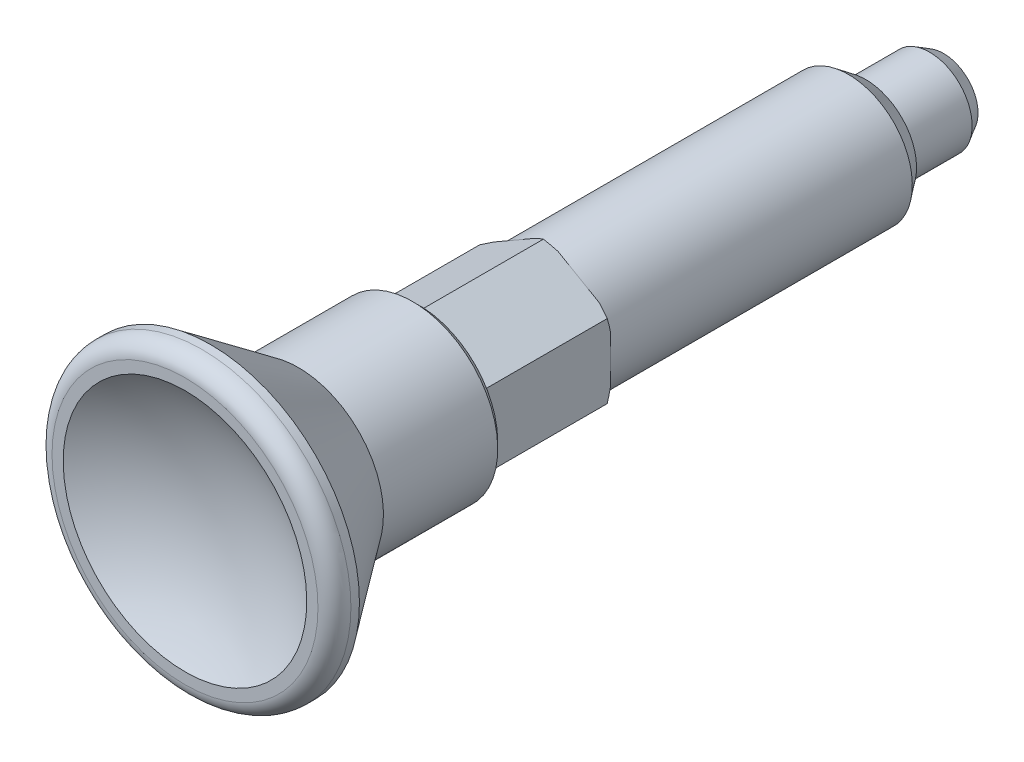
ISO-10303-21;
HEADER;
FILE_DESCRIPTION(('STEP AP214'),'2;1');
FILE_NAME('part.step','',(''),(''),'','','');
FILE_SCHEMA(('AUTOMOTIVE_DESIGN { 1 0 10303 214 1 1 1 1 }'));
ENDSEC;
DATA;
#1=APPLICATION_CONTEXT('core data for automotive mechanical design processes');
#2=APPLICATION_PROTOCOL_DEFINITION('international standard','automotive_design',2000,#1);
#3=PRODUCT_CONTEXT('',#1,'mechanical');
#4=PRODUCT('Part','Part','',(#3));
#5=PRODUCT_RELATED_PRODUCT_CATEGORY('part','',(#4));
#6=PRODUCT_DEFINITION_FORMATION('','',#4);
#7=PRODUCT_DEFINITION_CONTEXT('part definition',#1,'design');
#8=PRODUCT_DEFINITION('design','',#6,#7);
#9=PRODUCT_DEFINITION_SHAPE('','',#8);
#10=(LENGTH_UNIT() NAMED_UNIT(*) SI_UNIT(.MILLI.,.METRE.));
#11=(NAMED_UNIT(*) PLANE_ANGLE_UNIT() SI_UNIT($,.RADIAN.));
#12=(NAMED_UNIT(*) SI_UNIT($,.STERADIAN.) SOLID_ANGLE_UNIT());
#13=UNCERTAINTY_MEASURE_WITH_UNIT(LENGTH_MEASURE(1.E-05),#10,'distance_accuracy_value','');
#14=(GEOMETRIC_REPRESENTATION_CONTEXT(3) GLOBAL_UNCERTAINTY_ASSIGNED_CONTEXT((#13)) GLOBAL_UNIT_ASSIGNED_CONTEXT((#10,
#11,#12)) REPRESENTATION_CONTEXT('',''));
#15=CARTESIAN_POINT('',(0.,0.,0.));
#16=DIRECTION('',(0.,0.,1.));
#17=DIRECTION('',(1.,0.,0.));
#18=AXIS2_PLACEMENT_3D('',#15,#16,#17);
#19=CARTESIAN_POINT('',(3.,0.,0.));
#20=DIRECTION('',(0.,0.,-1.));
#21=DIRECTION('',(0.,1.,0.));
#22=AXIS2_PLACEMENT_3D('',#19,#20,#21);
#23=PLANE('',#22);
#24=CARTESIAN_POINT('',(0.,0.,3.69877739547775E-11));
#25=DIRECTION('',(0.,0.,1.));
#26=DIRECTION('',(0.,-1.,0.));
#27=AXIS2_PLACEMENT_3D('',#24,#25,#26);
#28=CIRCLE('',#27,3.1999999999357);
#29=CARTESIAN_POINT('',(2.46436507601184,2.04129977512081,5.38250000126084E-11));
#30=VERTEX_POINT('',#29);
#31=CARTESIAN_POINT('',(3.,1.11355287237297,3.53293783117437E-11));
#32=VERTEX_POINT('',#31);
#33=EDGE_CURVE('E157',#30,#32,#28,.F.);
#34=ORIENTED_EDGE('',*,*,#33,.T.);
#35=DIRECTION('',(0.,1.,0.));
#36=VECTOR('',#35,1.);
#37=CARTESIAN_POINT('',(3.,0.,0.));
#38=LINE('',#37,#36);
#39=CARTESIAN_POINT('',(3.,0.,0.));
#40=VERTEX_POINT('',#39);
#41=EDGE_CURVE('E162',#32,#40,#38,.F.);
#42=ORIENTED_EDGE('',*,*,#41,.T.);
#43=CARTESIAN_POINT('',(0.,0.,0.));
#44=DIRECTION('',(0.,0.,1.));
#45=DIRECTION('',(0.,-1.,0.));
#46=AXIS2_PLACEMENT_3D('',#43,#44,#45);
#47=CIRCLE('',#46,3.);
#48=CARTESIAN_POINT('',(1.5,2.59807621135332,0.));
#49=VERTEX_POINT('',#48);
#50=EDGE_CURVE('E331',#49,#40,#47,.F.);
#51=ORIENTED_EDGE('',*,*,#50,.F.);
#52=DIRECTION('',(0.866025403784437,-0.5,0.));
#53=VECTOR('',#52,1.);
#54=CARTESIAN_POINT('',(1.5,2.59807621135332,0.));
#55=LINE('',#54,#53);
#56=EDGE_CURVE('E181',#49,#30,#55,.T.);
#57=ORIENTED_EDGE('',*,*,#56,.T.);
#58=EDGE_LOOP('',(#34,#42,#51,#57));
#59=FACE_BOUND('',#58,.T.);
#60=ADVANCED_FACE('F14',(#59),#23,.T.);
#61=CARTESIAN_POINT('',(3.,0.,0.));
#62=DIRECTION('',(0.,0.,-1.));
#63=DIRECTION('',(0.,1.,0.));
#64=AXIS2_PLACEMENT_3D('',#61,#62,#63);
#65=PLANE('',#64);
#66=CARTESIAN_POINT('',(0.,0.,3.69877739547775E-11));
#67=DIRECTION('',(0.,0.,1.));
#68=DIRECTION('',(0.,-1.,0.));
#69=AXIS2_PLACEMENT_3D('',#66,#67,#68);
#70=CIRCLE('',#69,3.1999999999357);
#71=CARTESIAN_POINT('',(0.535634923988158,-3.15485264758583,5.38232652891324E-11));
#72=VERTEX_POINT('',#71);
#73=CARTESIAN_POINT('',(-0.53563492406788,-3.1548526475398,3.53311130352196E-11));
#74=VERTEX_POINT('',#73);
#75=EDGE_CURVE('E187',#72,#74,#70,.F.);
#76=ORIENTED_EDGE('',*,*,#75,.T.);
#77=DIRECTION('',(-0.86602540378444,0.5,0.));
#78=VECTOR('',#77,1.);
#79=CARTESIAN_POINT('',(-0.535634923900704,-3.15485264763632,0.));
#80=LINE('',#79,#78);
#81=CARTESIAN_POINT('',(-1.5,-2.59807621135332,0.));
#82=VERTEX_POINT('',#81);
#83=EDGE_CURVE('E350',#74,#82,#80,.T.);
#84=ORIENTED_EDGE('',*,*,#83,.T.);
#85=CARTESIAN_POINT('',(0.,0.,0.));
#86=DIRECTION('',(0.,0.,1.));
#87=DIRECTION('',(0.,-1.,0.));
#88=AXIS2_PLACEMENT_3D('',#85,#86,#87);
#89=CIRCLE('',#88,3.);
#90=CARTESIAN_POINT('',(1.5,-2.59807621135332,0.));
#91=VERTEX_POINT('',#90);
#92=EDGE_CURVE('E915',#91,#82,#89,.F.);
#93=ORIENTED_EDGE('',*,*,#92,.F.);
#94=DIRECTION('',(-0.86602540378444,-0.5,0.));
#95=VECTOR('',#94,1.);
#96=CARTESIAN_POINT('',(1.5,-2.59807621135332,0.));
#97=LINE('',#96,#95);
#98=EDGE_CURVE('E172',#91,#72,#97,.T.);
#99=ORIENTED_EDGE('',*,*,#98,.T.);
#100=EDGE_LOOP('',(#76,#84,#93,#99));
#101=FACE_BOUND('',#100,.T.);
#102=ADVANCED_FACE('F654',(#101),#65,.T.);
#103=CARTESIAN_POINT('',(3.,0.,0.));
#104=DIRECTION('',(0.,0.,-1.));
#105=DIRECTION('',(0.,1.,0.));
#106=AXIS2_PLACEMENT_3D('',#103,#104,#105);
#107=PLANE('',#106);
#108=CARTESIAN_POINT('',(0.,0.,0.));
#109=DIRECTION('',(0.,0.,1.));
#110=DIRECTION('',(0.,-1.,0.));
#111=AXIS2_PLACEMENT_3D('',#108,#109,#110);
#112=CIRCLE('',#111,3.);
#113=CARTESIAN_POINT('',(-3.,0.,0.));
#114=VERTEX_POINT('',#113);
#115=EDGE_CURVE('E912',#82,#114,#112,.F.);
#116=ORIENTED_EDGE('',*,*,#115,.F.);
#117=DIRECTION('',(-0.866025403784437,0.5,0.));
#118=VECTOR('',#117,1.);
#119=CARTESIAN_POINT('',(-1.5,-2.59807621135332,0.));
#120=LINE('',#119,#118);
#121=CARTESIAN_POINT('',(-2.46436507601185,-2.04129977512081,5.38250000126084E-11));
#122=VERTEX_POINT('',#121);
#123=EDGE_CURVE('E343',#82,#122,#120,.T.);
#124=ORIENTED_EDGE('',*,*,#123,.T.);
#125=CARTESIAN_POINT('',(0.,0.,3.69877739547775E-11));
#126=DIRECTION('',(0.,0.,1.));
#127=DIRECTION('',(0.,-1.,0.));
#128=AXIS2_PLACEMENT_3D('',#125,#126,#127);
#129=CIRCLE('',#128,3.1999999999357);
#130=CARTESIAN_POINT('',(-3.,-1.11355287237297,3.53293783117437E-11));
#131=VERTEX_POINT('',#130);
#132=EDGE_CURVE('E349',#122,#131,#129,.F.);
#133=ORIENTED_EDGE('',*,*,#132,.T.);
#134=DIRECTION('',(0.,1.,0.));
#135=VECTOR('',#134,1.);
#136=CARTESIAN_POINT('',(-3.,0.,0.));
#137=LINE('',#136,#135);
#138=EDGE_CURVE('E346',#131,#114,#137,.T.);
#139=ORIENTED_EDGE('',*,*,#138,.T.);
#140=EDGE_LOOP('',(#116,#124,#133,#139));
#141=FACE_BOUND('',#140,.T.);
#142=ADVANCED_FACE('F645',(#141),#107,.T.);
#143=CARTESIAN_POINT('',(3.,0.,0.));
#144=DIRECTION('',(0.,0.,-1.));
#145=DIRECTION('',(0.,1.,0.));
#146=AXIS2_PLACEMENT_3D('',#143,#144,#145);
#147=PLANE('',#146);
#148=CARTESIAN_POINT('',(0.,0.,3.69877739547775E-11));
#149=DIRECTION('',(0.,0.,1.));
#150=DIRECTION('',(0.,-1.,0.));
#151=AXIS2_PLACEMENT_3D('',#148,#149,#150);
#152=CIRCLE('',#151,3.1999999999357);
#153=CARTESIAN_POINT('',(-3.,1.11355287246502,5.38232652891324E-11));
#154=VERTEX_POINT('',#153);
#155=CARTESIAN_POINT('',(-2.46436507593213,2.04129977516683,3.53293783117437E-11));
#156=VERTEX_POINT('',#155);
#157=EDGE_CURVE('E339',#154,#156,#152,.F.);
#158=ORIENTED_EDGE('',*,*,#157,.T.);
#159=DIRECTION('',(0.866025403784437,0.5,0.));
#160=VECTOR('',#159,1.);
#161=CARTESIAN_POINT('',(-2.4643650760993,2.04129977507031,0.));
#162=LINE('',#161,#160);
#163=CARTESIAN_POINT('',(-1.5,2.59807621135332,0.));
#164=VERTEX_POINT('',#163);
#165=EDGE_CURVE('E336',#156,#164,#162,.T.);
#166=ORIENTED_EDGE('',*,*,#165,.T.);
#167=CARTESIAN_POINT('',(0.,0.,0.));
#168=DIRECTION('',(0.,0.,1.));
#169=DIRECTION('',(0.,-1.,0.));
#170=AXIS2_PLACEMENT_3D('',#167,#168,#169);
#171=CIRCLE('',#170,3.);
#172=EDGE_CURVE('E909',#114,#164,#171,.F.);
#173=ORIENTED_EDGE('',*,*,#172,.F.);
#174=DIRECTION('',(0.,1.,0.));
#175=VECTOR('',#174,1.);
#176=CARTESIAN_POINT('',(-3.,0.,0.));
#177=LINE('',#176,#175);
#178=EDGE_CURVE('E340',#114,#154,#177,.T.);
#179=ORIENTED_EDGE('',*,*,#178,.T.);
#180=EDGE_LOOP('',(#158,#166,#173,#179));
#181=FACE_BOUND('',#180,.T.);
#182=ADVANCED_FACE('F636',(#181),#147,.T.);
#183=CARTESIAN_POINT('',(3.,0.,0.));
#184=DIRECTION('',(0.,0.,-1.));
#185=DIRECTION('',(0.,1.,0.));
#186=AXIS2_PLACEMENT_3D('',#183,#184,#185);
#187=PLANE('',#186);
#188=CARTESIAN_POINT('',(0.,0.,3.69886413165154E-11));
#189=DIRECTION('',(0.,0.,1.));
#190=DIRECTION('',(0.,-1.,0.));
#191=AXIS2_PLACEMENT_3D('',#188,#189,#190);
#192=CIRCLE('',#191,3.1999999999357);
#193=CARTESIAN_POINT('',(-0.535634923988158,3.15485264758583,5.38232652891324E-11));
#194=VERTEX_POINT('',#193);
#195=CARTESIAN_POINT('',(0.535634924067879,3.1548526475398,3.53311130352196E-11));
#196=VERTEX_POINT('',#195);
#197=EDGE_CURVE('E332',#194,#196,#192,.F.);
#198=ORIENTED_EDGE('',*,*,#197,.T.);
#199=DIRECTION('',(0.86602540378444,-0.5,0.));
#200=VECTOR('',#199,1.);
#201=CARTESIAN_POINT('',(0.535634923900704,3.15485264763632,0.));
#202=LINE('',#201,#200);
#203=EDGE_CURVE('E328',#196,#49,#202,.T.);
#204=ORIENTED_EDGE('',*,*,#203,.T.);
#205=CARTESIAN_POINT('',(0.,0.,0.));
#206=DIRECTION('',(0.,0.,1.));
#207=DIRECTION('',(0.,-1.,0.));
#208=AXIS2_PLACEMENT_3D('',#205,#206,#207);
#209=CIRCLE('',#208,3.);
#210=EDGE_CURVE('E906',#164,#49,#209,.F.);
#211=ORIENTED_EDGE('',*,*,#210,.F.);
#212=DIRECTION('',(0.86602540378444,0.5,0.));
#213=VECTOR('',#212,1.);
#214=CARTESIAN_POINT('',(-1.5,2.59807621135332,0.));
#215=LINE('',#214,#213);
#216=EDGE_CURVE('E333',#164,#194,#215,.T.);
#217=ORIENTED_EDGE('',*,*,#216,.T.);
#218=EDGE_LOOP('',(#198,#204,#211,#217));
#219=FACE_BOUND('',#218,.T.);
#220=ADVANCED_FACE('F627',(#219),#187,.T.);
#221=CARTESIAN_POINT('',(0.,0.,-15.));
#222=DIRECTION('',(0.,0.,1.));
#223=DIRECTION('',(0.,-1.,0.));
#224=AXIS2_PLACEMENT_3D('',#221,#222,#223);
#225=CYLINDRICAL_SURFACE('',#224,3.);
#226=ORIENTED_EDGE('',*,*,#172,.T.);
#227=ORIENTED_EDGE('',*,*,#210,.T.);
#228=ORIENTED_EDGE('',*,*,#50,.T.);
#229=CARTESIAN_POINT('',(0.,0.,0.));
#230=DIRECTION('',(0.,0.,1.));
#231=DIRECTION('',(0.,-1.,0.));
#232=AXIS2_PLACEMENT_3D('',#229,#230,#231);
#233=CIRCLE('',#232,3.);
#234=EDGE_CURVE('E327',#91,#40,#233,.T.);
#235=ORIENTED_EDGE('',*,*,#234,.F.);
#236=ORIENTED_EDGE('',*,*,#92,.T.);
#237=ORIENTED_EDGE('',*,*,#115,.T.);
#238=EDGE_LOOP('',(#226,#227,#228,#235,#236,#237));
#239=FACE_BOUND('',#238,.T.);
#240=CARTESIAN_POINT('',(0.,0.,-14.1865));
#241=DIRECTION('',(0.,0.,1.));
#242=DIRECTION('',(0.,-1.,0.));
#243=AXIS2_PLACEMENT_3D('',#240,#241,#242);
#244=CIRCLE('',#243,3.);
#245=CARTESIAN_POINT('',(0.,-3.,-14.1865));
#246=VERTEX_POINT('',#245);
#247=EDGE_CURVE('E183',#246,#246,#244,.T.);
#248=ORIENTED_EDGE('',*,*,#247,.T.);
#249=EDGE_LOOP('',(#248));
#250=FACE_BOUND('',#249,.T.);
#251=ADVANCED_FACE('F357',(#239,#250),#225,.T.);
#252=CARTESIAN_POINT('',(3.,0.,0.));
#253=DIRECTION('',(0.,0.,-1.));
#254=DIRECTION('',(0.,1.,0.));
#255=AXIS2_PLACEMENT_3D('',#252,#253,#254);
#256=PLANE('',#255);
#257=CARTESIAN_POINT('',(0.,0.,3.69877739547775E-11));
#258=DIRECTION('',(0.,0.,1.));
#259=DIRECTION('',(0.,-1.,0.));
#260=AXIS2_PLACEMENT_3D('',#257,#258,#259);
#261=CIRCLE('',#260,3.1999999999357);
#262=CARTESIAN_POINT('',(2.46436507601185,-2.0412997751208,5.38232652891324E-11));
#263=VERTEX_POINT('',#262);
#264=CARTESIAN_POINT('',(3.,-1.11355287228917,1.84938869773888E-11));
#265=VERTEX_POINT('',#264);
#266=EDGE_CURVE('E326',#263,#265,#261,.T.);
#267=ORIENTED_EDGE('',*,*,#266,.F.);
#268=DIRECTION('',(0.866025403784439,0.5,0.));
#269=VECTOR('',#268,1.);
#270=CARTESIAN_POINT('',(0.,-3.46410161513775,0.));
#271=LINE('',#270,#269);
#272=EDGE_CURVE('E320',#91,#263,#271,.T.);
#273=ORIENTED_EDGE('',*,*,#272,.F.);
#274=ORIENTED_EDGE('',*,*,#234,.T.);
#275=DIRECTION('',(0.,1.,0.));
#276=VECTOR('',#275,1.);
#277=CARTESIAN_POINT('',(3.,0.,0.));
#278=LINE('',#277,#276);
#279=EDGE_CURVE('E167',#40,#265,#278,.F.);
#280=ORIENTED_EDGE('',*,*,#279,.T.);
#281=EDGE_LOOP('',(#267,#273,#274,#280));
#282=FACE_BOUND('',#281,.T.);
#283=ADVANCED_FACE('F610',(#282),#256,.T.);
#284=CARTESIAN_POINT('',(0.,0.,0.153394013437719));
#285=DIRECTION('',(0.,0.,1.));
#286=DIRECTION('',(0.,-1.,0.));
#287=AXIS2_PLACEMENT_3D('',#284,#285,#286);
#288=CONICAL_SURFACE('',#287,3.46568622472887,1.04719755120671);
#289=CARTESIAN_POINT('',(2.08275457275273E-11,-3.46410161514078,0.152479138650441));
#290=CARTESIAN_POINT('',(0.0441893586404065,-3.43858887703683,0.137749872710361));
#291=CARTESIAN_POINT('',(0.0884924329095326,-3.41301048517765,0.123469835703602));
#292=CARTESIAN_POINT('',(0.177307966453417,-3.36173281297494,0.0958975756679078));
#293=CARTESIAN_POINT('',(0.221820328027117,-3.33603358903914,0.0826049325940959));
#294=CARTESIAN_POINT('',(0.311076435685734,-3.28450155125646,0.0570834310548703));
#295=CARTESIAN_POINT('',(0.35582019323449,-3.25866873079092,0.0448546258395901));
#296=CARTESIAN_POINT('',(0.445551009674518,-3.20686261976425,0.021543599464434));
#297=CARTESIAN_POINT('',(0.490538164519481,-3.18088927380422,0.0104618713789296));
#298=CARTESIAN_POINT('',(0.535634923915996,-3.15485264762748,7.04766106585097E-11));
#299=B_SPLINE_CURVE_WITH_KNOTS('',3,(#289,#290,#291,#292,#293,#294,#295,#296,#297,#298),
.UNSPECIFIED.,.F.,.F.,(4,2,2,2,4),(0.,0.159326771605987,0.31858537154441,0.477851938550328,
0.63718668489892),.UNSPECIFIED.);
#300=CARTESIAN_POINT('',(8.13771874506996E-12,-3.46410161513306,0.152479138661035));
#301=VERTEX_POINT('',#300);
#302=EDGE_CURVE('E324',#301,#72,#299,.T.);
#303=ORIENTED_EDGE('',*,*,#302,.F.);
#304=CARTESIAN_POINT('',(-0.535634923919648,-3.15485264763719,6.46357967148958E-11));
#305=CARTESIAN_POINT('',(-0.490538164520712,-3.1808892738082,0.0104618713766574));
#306=CARTESIAN_POINT('',(-0.445551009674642,-3.20686261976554,0.021543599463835));
#307=CARTESIAN_POINT('',(-0.355820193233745,-3.25866873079,0.0448546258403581));
#308=CARTESIAN_POINT('',(-0.311076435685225,-3.28450155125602,0.057083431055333));
#309=CARTESIAN_POINT('',(-0.221820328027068,-3.33603358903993,0.0826049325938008));
#310=CARTESIAN_POINT('',(-0.177307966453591,-3.36173281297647,0.0958975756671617));
#311=CARTESIAN_POINT('',(-0.0884924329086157,-3.41301048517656,0.123469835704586));
#312=CARTESIAN_POINT('',(-0.0441893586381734,-3.43858887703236,0.137749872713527));
#313=CARTESIAN_POINT('',(-1.57160929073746E-11,-3.46410161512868,0.152479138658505));
#314=B_SPLINE_CURVE_WITH_KNOTS('',3,(#304,#305,#306,#307,#308,#309,#310,#311,#312,#313),
.UNSPECIFIED.,.F.,.F.,(4,2,2,2,4),(0.,0.159334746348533,0.318601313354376,0.477859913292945,
0.637186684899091),.UNSPECIFIED.);
#315=EDGE_CURVE('E709',#74,#301,#314,.T.);
#316=ORIENTED_EDGE('',*,*,#315,.F.);
#317=ORIENTED_EDGE('',*,*,#75,.F.);
#318=EDGE_LOOP('',(#303,#316,#317));
#319=FACE_BOUND('',#318,.T.);
#320=ADVANCED_FACE('F601',(#319),#288,.T.);
#321=CARTESIAN_POINT('',(0.,0.,0.153394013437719));
#322=DIRECTION('',(0.,0.,1.));
#323=DIRECTION('',(0.,-1.,0.));
#324=AXIS2_PLACEMENT_3D('',#321,#322,#323);
#325=CONICAL_SURFACE('',#324,3.46568622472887,1.04719755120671);
#326=CARTESIAN_POINT('',(-3.00000000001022,-1.11355287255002,6.46340619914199E-11));
#327=CARTESIAN_POINT('',(-3.00000000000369,-1.16562612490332,0.0104618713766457));
#328=CARTESIAN_POINT('',(-3.00000000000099,-1.21757281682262,0.0215435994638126));
#329=CARTESIAN_POINT('',(-2.99999999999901,-1.3211850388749,0.0448546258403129));
#330=CARTESIAN_POINT('',(-2.99999999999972,-1.37285067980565,0.0570834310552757));
#331=CARTESIAN_POINT('',(-3.00000000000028,-1.4759147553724,0.0826049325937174));
#332=CARTESIAN_POINT('',(-3.00000000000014,-1.5273132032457,0.0958975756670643));
#333=CARTESIAN_POINT('',(-2.99999999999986,-1.62986854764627,0.123469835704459));
#334=CARTESIAN_POINT('',(-2.99999999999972,-1.68102533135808,0.137749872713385));
#335=CARTESIAN_POINT('',(-3.,-1.73205080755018,0.152479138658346));
#336=B_SPLINE_CURVE_WITH_KNOTS('',3,(#326,#327,#328,#329,#330,#331,#332,#333,#334,#335),
.UNSPECIFIED.,.F.,.F.,(4,2,2,2,4),(0.,0.159334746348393,0.318601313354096,0.477859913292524,
0.63718668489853),.UNSPECIFIED.);
#337=CARTESIAN_POINT('',(-2.999999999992,-1.73205080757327,0.152479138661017));
#338=VERTEX_POINT('',#337);
#339=EDGE_CURVE('E856',#131,#338,#336,.T.);
#340=ORIENTED_EDGE('',*,*,#339,.F.);
#341=ORIENTED_EDGE('',*,*,#132,.F.);
#342=CARTESIAN_POINT('',(-2.99999999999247,-1.73205080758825,0.152479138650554));
#343=CARTESIAN_POINT('',(-2.95581064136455,-1.7575635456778,0.137749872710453));
#344=CARTESIAN_POINT('',(-2.91150756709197,-1.78314193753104,0.123469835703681));
#345=CARTESIAN_POINT('',(-2.82269203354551,-1.83441960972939,0.0958975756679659));
#346=CARTESIAN_POINT('',(-2.77817967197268,-1.86011883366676,0.0826049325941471));
#347=CARTESIAN_POINT('',(-2.68892356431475,-1.91165087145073,0.057083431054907));
#348=CARTESIAN_POINT('',(-2.64417980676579,-1.93748369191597,0.0448546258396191));
#349=CARTESIAN_POINT('',(-2.55444899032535,-1.98928980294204,0.0215435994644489));
#350=CARTESIAN_POINT('',(-2.50946183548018,-2.01526314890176,0.0104618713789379));
#351=CARTESIAN_POINT('',(-2.46436507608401,-2.04129977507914,7.04800801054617E-11));
#352=B_SPLINE_CURVE_WITH_KNOTS('',3,(#342,#343,#344,#345,#346,#347,#348,#349,#350,#351),
.UNSPECIFIED.,.F.,.F.,(4,2,2,2,4),(0.,0.15932677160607,0.318585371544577,0.477851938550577,
0.637186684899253),.UNSPECIFIED.);
#353=EDGE_CURVE('E717',#338,#122,#352,.T.);
#354=ORIENTED_EDGE('',*,*,#353,.F.);
#355=EDGE_LOOP('',(#340,#341,#354));
#356=FACE_BOUND('',#355,.T.);
#357=ADVANCED_FACE('F592',(#356),#325,.T.);
#358=CARTESIAN_POINT('',(0.,0.,0.153394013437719));
#359=DIRECTION('',(0.,0.,1.));
#360=DIRECTION('',(0.,-1.,0.));
#361=AXIS2_PLACEMENT_3D('',#358,#359,#360);
#362=CONICAL_SURFACE('',#361,3.46568622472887,1.04719755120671);
#363=CARTESIAN_POINT('',(-3.00000000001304,1.73205080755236,0.152479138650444));
#364=CARTESIAN_POINT('',(-3.00000000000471,1.68102533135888,0.137749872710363));
#365=CARTESIAN_POINT('',(-3.00000000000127,1.62986854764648,0.123469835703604));
#366=CARTESIAN_POINT('',(-2.99999999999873,1.52731320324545,0.0958975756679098));
#367=CARTESIAN_POINT('',(-2.99999999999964,1.47591475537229,0.0826049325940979));
#368=CARTESIAN_POINT('',(-3.00000000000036,1.37285067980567,0.057083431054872));
#369=CARTESIAN_POINT('',(-3.00000000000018,1.3211850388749,0.0448546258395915));
#370=CARTESIAN_POINT('',(-2.99999999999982,1.21757281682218,0.021543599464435));
#371=CARTESIAN_POINT('',(-2.99999999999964,1.16562612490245,0.0104618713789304));
#372=CARTESIAN_POINT('',(-3.,1.11355287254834,7.04774780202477E-11));
#373=B_SPLINE_CURVE_WITH_KNOTS('',3,(#363,#364,#365,#366,#367,#368,#369,#370,#371,#372),
.UNSPECIFIED.,.F.,.F.,(4,2,2,2,4),(0.,0.159326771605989,0.318585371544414,0.477851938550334,
0.637186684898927),.UNSPECIFIED.);
#374=CARTESIAN_POINT('',(-3.,1.73205080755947,0.152479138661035));
#375=VERTEX_POINT('',#374);
#376=EDGE_CURVE('E866',#375,#154,#373,.T.);
#377=ORIENTED_EDGE('',*,*,#376,.F.);
#378=CARTESIAN_POINT('',(-2.46436507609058,2.04129977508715,6.46340619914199E-11));
#379=CARTESIAN_POINT('',(-2.50946183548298,2.01526314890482,0.0104618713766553));
#380=CARTESIAN_POINT('',(-2.55444899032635,1.98928980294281,0.0215435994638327));
#381=CARTESIAN_POINT('',(-2.64417980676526,1.93748369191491,0.044854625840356));
#382=CARTESIAN_POINT('',(-2.68892356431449,1.91165087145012,0.0570834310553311));
#383=CARTESIAN_POINT('',(-2.77817967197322,1.86011883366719,0.0826049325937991));
#384=CARTESIAN_POINT('',(-2.82269203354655,1.8344196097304,0.0958975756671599));
#385=CARTESIAN_POINT('',(-2.91150756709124,1.78314193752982,0.123469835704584));
#386=CARTESIAN_POINT('',(-2.95581064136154,1.75756354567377,0.137749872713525));
#387=CARTESIAN_POINT('',(-2.99999999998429,1.73205080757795,0.152479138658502));
#388=B_SPLINE_CURVE_WITH_KNOTS('',3,(#378,#379,#380,#381,#382,#383,#384,#385,#386,#387),
.UNSPECIFIED.,.F.,.F.,(4,2,2,2,4),(0.,0.159334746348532,0.318601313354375,0.477859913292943,
0.637186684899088),.UNSPECIFIED.);
#389=EDGE_CURVE('E834',#156,#375,#388,.T.);
#390=ORIENTED_EDGE('',*,*,#389,.F.);
#391=ORIENTED_EDGE('',*,*,#157,.F.);
#392=EDGE_LOOP('',(#377,#390,#391));
#393=FACE_BOUND('',#392,.T.);
#394=ADVANCED_FACE('F583',(#393),#362,.T.);
#395=CARTESIAN_POINT('',(0.,0.,0.153394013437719));
#396=DIRECTION('',(0.,0.,1.));
#397=DIRECTION('',(0.,-1.,0.));
#398=AXIS2_PLACEMENT_3D('',#395,#396,#397);
#399=CONICAL_SURFACE('',#398,3.46568622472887,1.04719755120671);
#400=CARTESIAN_POINT('',(-2.08273058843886E-11,3.46410161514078,0.152479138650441));
#401=CARTESIAN_POINT('',(-0.0441893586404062,3.43858887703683,0.137749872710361));
#402=CARTESIAN_POINT('',(-0.0884924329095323,3.41301048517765,0.123469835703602));
#403=CARTESIAN_POINT('',(-0.177307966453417,3.36173281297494,0.0958975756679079));
#404=CARTESIAN_POINT('',(-0.221820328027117,3.33603358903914,0.0826049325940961));
#405=CARTESIAN_POINT('',(-0.311076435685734,3.28450155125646,0.0570834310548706));
#406=CARTESIAN_POINT('',(-0.35582019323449,3.25866873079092,0.0448546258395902));
#407=CARTESIAN_POINT('',(-0.445551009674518,3.20686261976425,0.0215435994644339));
#408=CARTESIAN_POINT('',(-0.490538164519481,3.18088927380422,0.0104618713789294));
#409=CARTESIAN_POINT('',(-0.535634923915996,3.15485264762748,7.04766106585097E-11));
#410=B_SPLINE_CURVE_WITH_KNOTS('',3,(#400,#401,#402,#403,#404,#405,#406,#407,#408,#409),
.UNSPECIFIED.,.F.,.F.,(4,2,2,2,4),(0.,0.159326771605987,0.31858537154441,0.477851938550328,
0.63718668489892),.UNSPECIFIED.);
#411=CARTESIAN_POINT('',(-8.13761224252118E-12,3.46410161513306,0.152479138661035));
#412=VERTEX_POINT('',#411);
#413=EDGE_CURVE('E794',#412,#194,#410,.T.);
#414=ORIENTED_EDGE('',*,*,#413,.F.);
#415=CARTESIAN_POINT('',(0.535634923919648,3.15485264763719,6.46357967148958E-11));
#416=CARTESIAN_POINT('',(0.490538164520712,3.1808892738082,0.0104618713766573));
#417=CARTESIAN_POINT('',(0.445551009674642,3.20686261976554,0.0215435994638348));
#418=CARTESIAN_POINT('',(0.355820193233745,3.25866873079,0.044854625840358));
#419=CARTESIAN_POINT('',(0.311076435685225,3.28450155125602,0.057083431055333));
#420=CARTESIAN_POINT('',(0.221820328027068,3.33603358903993,0.0826049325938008));
#421=CARTESIAN_POINT('',(0.177307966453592,3.36173281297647,0.0958975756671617));
#422=CARTESIAN_POINT('',(0.0884924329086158,3.41301048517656,0.123469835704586));
#423=CARTESIAN_POINT('',(0.0441893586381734,3.43858887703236,0.137749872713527));
#424=CARTESIAN_POINT('',(1.57162021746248E-11,3.46410161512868,0.152479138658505));
#425=B_SPLINE_CURVE_WITH_KNOTS('',3,(#415,#416,#417,#418,#419,#420,#421,#422,#423,#424),
.UNSPECIFIED.,.F.,.F.,(4,2,2,2,4),(0.,0.159334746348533,0.318601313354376,0.477859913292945,
0.637186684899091),.UNSPECIFIED.);
#426=EDGE_CURVE('E802',#196,#412,#425,.T.);
#427=ORIENTED_EDGE('',*,*,#426,.F.);
#428=ORIENTED_EDGE('',*,*,#197,.F.);
#429=EDGE_LOOP('',(#414,#427,#428));
#430=FACE_BOUND('',#429,.T.);
#431=ADVANCED_FACE('F574',(#430),#399,.T.);
#432=CARTESIAN_POINT('',(0.,0.,0.153394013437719));
#433=DIRECTION('',(0.,0.,1.));
#434=DIRECTION('',(0.,-1.,0.));
#435=AXIS2_PLACEMENT_3D('',#432,#433,#434);
#436=CONICAL_SURFACE('',#435,3.46568622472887,1.04719755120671);
#437=CARTESIAN_POINT('',(3.00000000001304,-1.73205080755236,0.152479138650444));
#438=CARTESIAN_POINT('',(3.00000000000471,-1.68102533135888,0.137749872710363));
#439=CARTESIAN_POINT('',(3.00000000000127,-1.62986854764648,0.123469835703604));
#440=CARTESIAN_POINT('',(2.99999999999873,-1.52731320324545,0.0958975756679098));
#441=CARTESIAN_POINT('',(2.99999999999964,-1.47591475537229,0.0826049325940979));
#442=CARTESIAN_POINT('',(3.00000000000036,-1.37285067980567,0.057083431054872));
#443=CARTESIAN_POINT('',(3.00000000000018,-1.3211850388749,0.0448546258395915));
#444=CARTESIAN_POINT('',(2.99999999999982,-1.21757281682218,0.021543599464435));
#445=CARTESIAN_POINT('',(2.99999999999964,-1.16562612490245,0.0104618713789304));
#446=CARTESIAN_POINT('',(3.,-1.11355287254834,7.04774780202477E-11));
#447=B_SPLINE_CURVE_WITH_KNOTS('',3,(#437,#438,#439,#440,#441,#442,#443,#444,#445,#446),
.UNSPECIFIED.,.F.,.F.,(4,2,2,2,4),(0.,0.159326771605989,0.318585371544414,0.477851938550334,
0.637186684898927),.UNSPECIFIED.);
#448=CARTESIAN_POINT('',(2.99999999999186,-1.73205080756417,0.152479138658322));
#449=VERTEX_POINT('',#448);
#450=EDGE_CURVE('E178',#449,#265,#447,.T.);
#451=ORIENTED_EDGE('',*,*,#450,.F.);
#452=CARTESIAN_POINT('',(2.46436507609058,-2.04129977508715,6.46340619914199E-11));
#453=CARTESIAN_POINT('',(2.50946183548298,-2.01526314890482,0.0104618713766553));
#454=CARTESIAN_POINT('',(2.55444899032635,-1.98928980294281,0.0215435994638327));
#455=CARTESIAN_POINT('',(2.64417980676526,-1.93748369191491,0.044854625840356));
#456=CARTESIAN_POINT('',(2.68892356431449,-1.91165087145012,0.0570834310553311));
#457=CARTESIAN_POINT('',(2.77817967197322,-1.86011883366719,0.0826049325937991));
#458=CARTESIAN_POINT('',(2.82269203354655,-1.8344196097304,0.0958975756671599));
#459=CARTESIAN_POINT('',(2.91150756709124,-1.78314193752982,0.123469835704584));
#460=CARTESIAN_POINT('',(2.95581064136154,-1.75756354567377,0.137749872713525));
#461=CARTESIAN_POINT('',(2.99999999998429,-1.73205080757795,0.152479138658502));
#462=B_SPLINE_CURVE_WITH_KNOTS('',3,(#452,#453,#454,#455,#456,#457,#458,#459,#460,#461),
.UNSPECIFIED.,.F.,.F.,(4,2,2,2,4),(0.,0.159334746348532,0.318601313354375,0.477859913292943,
0.637186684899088),.UNSPECIFIED.);
#463=EDGE_CURVE('E323',#263,#449,#462,.T.);
#464=ORIENTED_EDGE('',*,*,#463,.F.);
#465=ORIENTED_EDGE('',*,*,#266,.T.);
#466=EDGE_LOOP('',(#451,#464,#465));
#467=FACE_BOUND('',#466,.T.);
#468=ADVANCED_FACE('F566',(#467),#436,.T.);
#469=CARTESIAN_POINT('',(0.,0.,0.153394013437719));
#470=DIRECTION('',(0.,0.,1.));
#471=DIRECTION('',(0.,-1.,0.));
#472=AXIS2_PLACEMENT_3D('',#469,#470,#471);
#473=CONICAL_SURFACE('',#472,3.46568622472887,1.04719755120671);
#474=CARTESIAN_POINT('',(2.99999999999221,1.73205080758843,0.152479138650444));
#475=CARTESIAN_POINT('',(2.9558106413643,1.75756354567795,0.137749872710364));
#476=CARTESIAN_POINT('',(2.91150756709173,1.78314193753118,0.123469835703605));
#477=CARTESIAN_POINT('',(2.82269203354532,1.83441960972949,0.0958975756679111));
#478=CARTESIAN_POINT('',(2.77817967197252,1.86011883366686,0.0826049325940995));
#479=CARTESIAN_POINT('',(2.68892356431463,1.9116508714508,0.0570834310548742));
#480=CARTESIAN_POINT('',(2.64417980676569,1.93748369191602,0.0448546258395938));
#481=CARTESIAN_POINT('',(2.5544489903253,1.98928980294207,0.0215435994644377));
#482=CARTESIAN_POINT('',(2.50946183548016,2.01526314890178,0.0104618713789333));
#483=CARTESIAN_POINT('',(2.46436507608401,2.04129977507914,7.04809474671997E-11));
#484=B_SPLINE_CURVE_WITH_KNOTS('',3,(#474,#475,#476,#477,#478,#479,#480,#481,#482,#483),
.UNSPECIFIED.,.F.,.F.,(4,2,2,2,4),(0.,0.159326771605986,0.318585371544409,0.477851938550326,
0.637186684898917),.UNSPECIFIED.);
#485=CARTESIAN_POINT('',(2.99999999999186,1.73205080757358,0.152479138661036));
#486=VERTEX_POINT('',#485);
#487=EDGE_CURVE('E175',#486,#30,#484,.T.);
#488=ORIENTED_EDGE('',*,*,#487,.F.);
#489=CARTESIAN_POINT('',(3.00000000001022,1.11355287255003,6.46349293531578E-11));
#490=CARTESIAN_POINT('',(3.00000000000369,1.16562612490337,0.0104618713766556));
#491=CARTESIAN_POINT('',(3.00000000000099,1.21757281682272,0.0215435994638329));
#492=CARTESIAN_POINT('',(2.99999999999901,1.32118503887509,0.0448546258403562));
#493=CARTESIAN_POINT('',(2.99999999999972,1.37285067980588,0.0570834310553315));
#494=CARTESIAN_POINT('',(3.00000000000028,1.47591475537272,0.0826049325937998));
#495=CARTESIAN_POINT('',(3.00000000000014,1.52731320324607,0.0958975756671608));
#496=CARTESIAN_POINT('',(2.99999999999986,1.62986854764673,0.123469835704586));
#497=CARTESIAN_POINT('',(2.99999999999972,1.68102533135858,0.137749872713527));
#498=CARTESIAN_POINT('',(3.,1.73205080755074,0.152479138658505));
#499=B_SPLINE_CURVE_WITH_KNOTS('',3,(#489,#490,#491,#492,#493,#494,#495,#496,#497,#498),
.UNSPECIFIED.,.F.,.F.,(4,2,2,2,4),(0.,0.159334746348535,0.318601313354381,0.477859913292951,
0.6371866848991),.UNSPECIFIED.);
#500=EDGE_CURVE('E165',#32,#486,#499,.T.);
#501=ORIENTED_EDGE('',*,*,#500,.F.);
#502=ORIENTED_EDGE('',*,*,#33,.F.);
#503=EDGE_LOOP('',(#488,#501,#502));
#504=FACE_BOUND('',#503,.T.);
#505=ADVANCED_FACE('F174',(#504),#473,.T.);
#506=CARTESIAN_POINT('',(0.,-3.46410161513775,0.));
#507=DIRECTION('',(0.5,-0.866025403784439,0.));
#508=DIRECTION('',(0.866025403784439,0.5,0.));
#509=AXIS2_PLACEMENT_3D('',#506,#507,#508);
#510=PLANE('',#509);
#511=ORIENTED_EDGE('',*,*,#272,.T.);
#512=ORIENTED_EDGE('',*,*,#463,.T.);
#513=DIRECTION('',(0.,0.,1.));
#514=VECTOR('',#513,1.);
#515=CARTESIAN_POINT('',(3.,-1.73205080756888,0.));
#516=LINE('',#515,#514);
#517=CARTESIAN_POINT('',(3.,-1.73205082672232,5.87684738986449));
#518=VERTEX_POINT('',#517);
#519=EDGE_CURVE('E293',#518,#449,#516,.F.);
#520=ORIENTED_EDGE('',*,*,#519,.F.);
#521=CARTESIAN_POINT('',(2.4643650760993,-2.04129977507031,6.));
#522=CARTESIAN_POINT('',(2.50930662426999,-2.01535276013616,5.99157944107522));
#523=CARTESIAN_POINT('',(2.55417623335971,-1.98944727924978,5.98265459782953));
#524=CARTESIAN_POINT('',(2.64375416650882,-1.93772943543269,5.96386416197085));
#525=CARTESIAN_POINT('',(2.68846253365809,-1.91191704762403,5.95399884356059));
#526=CARTESIAN_POINT('',(2.77772522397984,-1.86038120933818,5.93339064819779));
#527=CARTESIAN_POINT('',(2.82227955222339,-1.8346577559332,5.92264780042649));
#528=CARTESIAN_POINT('',(2.91124817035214,-1.78329170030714,5.90034448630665));
#529=CARTESIAN_POINT('',(2.95566241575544,-1.75764912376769,5.88878378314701));
#530=CARTESIAN_POINT('',(2.9999999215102,-1.73205085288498,5.87684741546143));
#531=B_SPLINE_CURVE_WITH_KNOTS('',3,(#521,#522,#523,#524,#525,#526,#527,#528,#529,#530),
.UNSPECIFIED.,.F.,.F.,(4,2,2,2,4),(0.,0.157714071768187,0.315382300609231,0.473045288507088,
0.630754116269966),.UNSPECIFIED.);
#532=CARTESIAN_POINT('',(2.46436507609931,-2.0412997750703,6.));
#533=VERTEX_POINT('',#532);
#534=EDGE_CURVE('E177',#533,#518,#531,.T.);
#535=ORIENTED_EDGE('',*,*,#534,.F.);
#536=DIRECTION('',(-0.866025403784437,-0.5,0.));
#537=VECTOR('',#536,1.);
#538=CARTESIAN_POINT('',(2.46436507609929,-2.04129977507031,6.));
#539=LINE('',#538,#537);
#540=CARTESIAN_POINT('',(0.535634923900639,-3.15485264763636,6.));
#541=VERTEX_POINT('',#540);
#542=EDGE_CURVE('E289',#533,#541,#539,.T.);
#543=ORIENTED_EDGE('',*,*,#542,.T.);
#544=CARTESIAN_POINT('',(0.,-3.46410161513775,5.87684739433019));
#545=CARTESIAN_POINT('',(0.0443375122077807,-3.43850334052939,5.88878376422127));
#546=CARTESIAN_POINT('',(0.0887517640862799,-3.41286076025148,5.90034446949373));
#547=CARTESIAN_POINT('',(0.177720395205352,-3.36149469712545,5.92264778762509));
#548=CARTESIAN_POINT('',(0.222274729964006,-3.33577123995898,5.93339063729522));
#549=CARTESIAN_POINT('',(0.311537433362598,-3.28423539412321,5.95399883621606));
#550=CARTESIAN_POINT('',(0.356245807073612,-3.25842300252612,5.96386415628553));
#551=CARTESIAN_POINT('',(0.445823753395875,-3.20670515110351,5.98265459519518));
#552=CARTESIAN_POINT('',(0.490693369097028,-3.18079966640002,5.99157943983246));
#553=CARTESIAN_POINT('',(0.535634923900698,-3.15485264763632,6.));
#554=B_SPLINE_CURVE_WITH_KNOTS('',3,(#544,#545,#546,#547,#548,#549,#550,#551,#552,#553),
.UNSPECIFIED.,.F.,.F.,(4,2,2,2,4),(0.,0.157708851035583,0.315371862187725,0.473040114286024,
0.630754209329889),.UNSPECIFIED.);
#555=CARTESIAN_POINT('',(0.,-3.46410161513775,5.87684739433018));
#556=VERTEX_POINT('',#555);
#557=EDGE_CURVE('E319',#556,#541,#554,.T.);
#558=ORIENTED_EDGE('',*,*,#557,.F.);
#559=DIRECTION('',(0.,0.,1.));
#560=VECTOR('',#559,1.);
#561=CARTESIAN_POINT('',(0.,-3.46410161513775,0.));
#562=LINE('',#561,#560);
#563=EDGE_CURVE('E315',#301,#556,#562,.T.);
#564=ORIENTED_EDGE('',*,*,#563,.F.);
#565=ORIENTED_EDGE('',*,*,#302,.T.);
#566=ORIENTED_EDGE('',*,*,#98,.F.);
#567=EDGE_LOOP('',(#511,#512,#520,#535,#543,#558,#564,#565,#566));
#568=FACE_BOUND('',#567,.T.);
#569=ADVANCED_FACE('F549',(#568),#510,.T.);
#570=CARTESIAN_POINT('',(0.,0.,5.87610847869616));
#571=DIRECTION('',(0.,0.,-1.));
#572=DIRECTION('',(0.,1.,0.));
#573=AXIS2_PLACEMENT_3D('',#570,#571,#572);
#574=CONICAL_SURFACE('',#573,3.46568622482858,1.13446401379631);
#575=ORIENTED_EDGE('',*,*,#557,.T.);
#576=CARTESIAN_POINT('',(0.,0.,6.));
#577=DIRECTION('',(0.,0.,-1.));
#578=DIRECTION('',(0.,1.,0.));
#579=AXIS2_PLACEMENT_3D('',#576,#577,#578);
#580=CIRCLE('',#579,3.2);
#581=CARTESIAN_POINT('',(-0.53563492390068,-3.15485264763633,6.));
#582=VERTEX_POINT('',#581);
#583=EDGE_CURVE('E288',#541,#582,#580,.T.);
#584=ORIENTED_EDGE('',*,*,#583,.T.);
#585=CARTESIAN_POINT('',(0.,-3.46410161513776,5.87684739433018));
#586=CARTESIAN_POINT('',(-0.0443375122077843,-3.4385033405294,5.88878376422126));
#587=CARTESIAN_POINT('',(-0.0887517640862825,-3.41286076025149,5.90034446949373));
#588=CARTESIAN_POINT('',(-0.177720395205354,-3.36149469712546,5.92264778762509));
#589=CARTESIAN_POINT('',(-0.222274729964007,-3.33577123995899,5.93339063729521));
#590=CARTESIAN_POINT('',(-0.311537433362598,-3.28423539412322,5.95399883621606));
#591=CARTESIAN_POINT('',(-0.356245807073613,-3.25842300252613,5.96386415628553));
#592=CARTESIAN_POINT('',(-0.445823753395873,-3.20670515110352,5.98265459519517));
#593=CARTESIAN_POINT('',(-0.490693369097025,-3.18079966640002,5.99157943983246));
#594=CARTESIAN_POINT('',(-0.535634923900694,-3.15485264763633,6.));
#595=B_SPLINE_CURVE_WITH_KNOTS('',3,(#585,#586,#587,#588,#589,#590,#591,#592,#593,#594),
.UNSPECIFIED.,.F.,.F.,(4,2,2,2,4),(0.,0.157708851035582,0.315371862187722,0.473040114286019,
0.630754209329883),.UNSPECIFIED.);
#596=EDGE_CURVE('E318',#556,#582,#595,.T.);
#597=ORIENTED_EDGE('',*,*,#596,.F.);
#598=EDGE_LOOP('',(#575,#584,#597));
#599=FACE_BOUND('',#598,.T.);
#600=ADVANCED_FACE('F540',(#599),#574,.T.);
#601=CARTESIAN_POINT('',(-3.,-1.73205080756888,0.));
#602=DIRECTION('',(-0.5,-0.866025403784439,0.));
#603=DIRECTION('',(0.866025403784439,-0.5,0.));
#604=AXIS2_PLACEMENT_3D('',#601,#602,#603);
#605=PLANE('',#604);
#606=ORIENTED_EDGE('',*,*,#83,.F.);
#607=ORIENTED_EDGE('',*,*,#315,.T.);
#608=ORIENTED_EDGE('',*,*,#563,.T.);
#609=ORIENTED_EDGE('',*,*,#596,.T.);
#610=DIRECTION('',(-0.86602540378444,0.5,0.));
#611=VECTOR('',#610,1.);
#612=CARTESIAN_POINT('',(-0.535634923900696,-3.15485264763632,6.));
#613=LINE('',#612,#611);
#614=CARTESIAN_POINT('',(-2.46436507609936,-2.04129977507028,6.));
#615=VERTEX_POINT('',#614);
#616=EDGE_CURVE('E286',#582,#615,#613,.T.);
#617=ORIENTED_EDGE('',*,*,#616,.T.);
#618=CARTESIAN_POINT('',(-3.,-1.73205080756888,5.87684739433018));
#619=CARTESIAN_POINT('',(-2.95566248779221,-1.75764908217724,5.88878376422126));
#620=CARTESIAN_POINT('',(-2.91124823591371,-1.78329166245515,5.90034446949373));
#621=CARTESIAN_POINT('',(-2.82227960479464,-1.83465772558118,5.92264778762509));
#622=CARTESIAN_POINT('',(-2.77772527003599,-1.86038118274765,5.93339063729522));
#623=CARTESIAN_POINT('',(-2.6884625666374,-1.91191702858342,5.95399883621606));
#624=CARTESIAN_POINT('',(-2.64375419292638,-1.93772942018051,5.96386415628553));
#625=CARTESIAN_POINT('',(-2.55417624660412,-1.98944727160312,5.98265459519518));
#626=CARTESIAN_POINT('',(-2.50930663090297,-2.01535275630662,5.99157943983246));
#627=CARTESIAN_POINT('',(-2.4643650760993,-2.04129977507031,6.));
#628=B_SPLINE_CURVE_WITH_KNOTS('',3,(#618,#619,#620,#621,#622,#623,#624,#625,#626,#627),
.UNSPECIFIED.,.F.,.F.,(4,2,2,2,4),(0.,0.157708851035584,0.315371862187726,0.473040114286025,
0.630754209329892),.UNSPECIFIED.);
#629=CARTESIAN_POINT('',(-3.,-1.73205080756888,5.87684739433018));
#630=VERTEX_POINT('',#629);
#631=EDGE_CURVE('E314',#630,#615,#628,.T.);
#632=ORIENTED_EDGE('',*,*,#631,.F.);
#633=DIRECTION('',(0.,0.,1.));
#634=VECTOR('',#633,1.);
#635=CARTESIAN_POINT('',(-3.,-1.73205080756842,0.));
#636=LINE('',#635,#634);
#637=EDGE_CURVE('E310',#338,#630,#636,.T.);
#638=ORIENTED_EDGE('',*,*,#637,.F.);
#639=ORIENTED_EDGE('',*,*,#353,.T.);
#640=ORIENTED_EDGE('',*,*,#123,.F.);
#641=EDGE_LOOP('',(#606,#607,#608,#609,#617,#632,#638,#639,#640));
#642=FACE_BOUND('',#641,.T.);
#643=ADVANCED_FACE('F531',(#642),#605,.T.);
#644=CARTESIAN_POINT('',(0.,0.,5.87610847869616));
#645=DIRECTION('',(0.,0.,-1.));
#646=DIRECTION('',(0.,1.,0.));
#647=AXIS2_PLACEMENT_3D('',#644,#645,#646);
#648=CONICAL_SURFACE('',#647,3.46568622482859,1.13446401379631);
#649=CARTESIAN_POINT('',(-3.,-1.73205080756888,5.87684739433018));
#650=CARTESIAN_POINT('',(-3.,-1.68085425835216,5.88878376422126));
#651=CARTESIAN_POINT('',(-3.,-1.62956909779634,5.90034446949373));
#652=CARTESIAN_POINT('',(-3.,-1.52683697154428,5.92264778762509));
#653=CARTESIAN_POINT('',(-3.,-1.47539005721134,5.93339063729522));
#654=CARTESIAN_POINT('',(-3.,-1.37231836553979,5.95399883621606));
#655=CARTESIAN_POINT('',(-3.,-1.32069358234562,5.96386415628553));
#656=CARTESIAN_POINT('',(-3.,-1.2172578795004,5.98265459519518));
#657=CARTESIAN_POINT('',(-3.,-1.16544691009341,5.99157943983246));
#658=CARTESIAN_POINT('',(-3.,-1.11355287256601,6.));
#659=B_SPLINE_CURVE_WITH_KNOTS('',3,(#649,#650,#651,#652,#653,#654,#655,#656,#657,#658),
.UNSPECIFIED.,.F.,.F.,(4,2,2,2,4),(0.,0.157708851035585,0.315371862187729,0.473040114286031,
0.630754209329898),.UNSPECIFIED.);
#660=CARTESIAN_POINT('',(-3.,-1.11355287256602,6.));
#661=VERTEX_POINT('',#660);
#662=EDGE_CURVE('E313',#630,#661,#659,.T.);
#663=ORIENTED_EDGE('',*,*,#662,.F.);
#664=ORIENTED_EDGE('',*,*,#631,.T.);
#665=CARTESIAN_POINT('',(0.,0.,6.));
#666=DIRECTION('',(0.,0.,-1.));
#667=DIRECTION('',(0.,1.,0.));
#668=AXIS2_PLACEMENT_3D('',#665,#666,#667);
#669=CIRCLE('',#668,3.2);
#670=EDGE_CURVE('E285',#615,#661,#669,.T.);
#671=ORIENTED_EDGE('',*,*,#670,.T.);
#672=EDGE_LOOP('',(#663,#664,#671));
#673=FACE_BOUND('',#672,.T.);
#674=ADVANCED_FACE('F522',(#673),#648,.T.);
#675=CARTESIAN_POINT('',(-3.,1.73205080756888,0.));
#676=DIRECTION('',(-1.,0.,0.));
#677=DIRECTION('',(0.,-1.,0.));
#678=AXIS2_PLACEMENT_3D('',#675,#676,#677);
#679=PLANE('',#678);
#680=ORIENTED_EDGE('',*,*,#138,.F.);
#681=ORIENTED_EDGE('',*,*,#339,.T.);
#682=ORIENTED_EDGE('',*,*,#637,.T.);
#683=ORIENTED_EDGE('',*,*,#662,.T.);
#684=DIRECTION('',(0.,-1.,0.));
#685=VECTOR('',#684,1.);
#686=CARTESIAN_POINT('',(-3.,0.,6.));
#687=LINE('',#686,#685);
#688=CARTESIAN_POINT('',(-3.,1.11355287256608,6.));
#689=VERTEX_POINT('',#688);
#690=EDGE_CURVE('E283',#661,#689,#687,.F.);
#691=ORIENTED_EDGE('',*,*,#690,.T.);
#692=CARTESIAN_POINT('',(-3.,1.73205080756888,5.87684739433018));
#693=CARTESIAN_POINT('',(-3.,1.68085425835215,5.88878376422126));
#694=CARTESIAN_POINT('',(-3.,1.62956909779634,5.90034446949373));
#695=CARTESIAN_POINT('',(-3.,1.52683697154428,5.92264778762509));
#696=CARTESIAN_POINT('',(-3.,1.47539005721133,5.93339063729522));
#697=CARTESIAN_POINT('',(-3.,1.37231836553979,5.95399883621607));
#698=CARTESIAN_POINT('',(-3.,1.32069358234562,5.96386415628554));
#699=CARTESIAN_POINT('',(-3.,1.21725787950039,5.98265459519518));
#700=CARTESIAN_POINT('',(-3.,1.1654469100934,5.99157943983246));
#701=CARTESIAN_POINT('',(-3.,1.113552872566,6.));
#702=B_SPLINE_CURVE_WITH_KNOTS('',3,(#692,#693,#694,#695,#696,#697,#698,#699,#700,#701),
.UNSPECIFIED.,.F.,.F.,(4,2,2,2,4),(0.,0.157708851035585,0.315371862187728,0.473040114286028,
0.630754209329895),.UNSPECIFIED.);
#703=CARTESIAN_POINT('',(-3.,1.73205080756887,5.87684739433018));
#704=VERTEX_POINT('',#703);
#705=EDGE_CURVE('E309',#704,#689,#702,.T.);
#706=ORIENTED_EDGE('',*,*,#705,.F.);
#707=DIRECTION('',(0.,0.,1.));
#708=VECTOR('',#707,1.);
#709=CARTESIAN_POINT('',(-3.,1.73205080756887,0.));
#710=LINE('',#709,#708);
#711=EDGE_CURVE('E305',#375,#704,#710,.T.);
#712=ORIENTED_EDGE('',*,*,#711,.F.);
#713=ORIENTED_EDGE('',*,*,#376,.T.);
#714=ORIENTED_EDGE('',*,*,#178,.F.);
#715=EDGE_LOOP('',(#680,#681,#682,#683,#691,#706,#712,#713,#714));
#716=FACE_BOUND('',#715,.T.);
#717=ADVANCED_FACE('F513',(#716),#679,.T.);
#718=CARTESIAN_POINT('',(0.,0.,5.87610847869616));
#719=DIRECTION('',(0.,0.,-1.));
#720=DIRECTION('',(0.,1.,0.));
#721=AXIS2_PLACEMENT_3D('',#718,#719,#720);
#722=CONICAL_SURFACE('',#721,3.46568622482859,1.13446401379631);
#723=ORIENTED_EDGE('',*,*,#705,.T.);
#724=CARTESIAN_POINT('',(0.,0.,6.));
#725=DIRECTION('',(0.,0.,-1.));
#726=DIRECTION('',(0.,1.,0.));
#727=AXIS2_PLACEMENT_3D('',#724,#725,#726);
#728=CIRCLE('',#727,3.2);
#729=CARTESIAN_POINT('',(-2.46436507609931,2.0412997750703,6.));
#730=VERTEX_POINT('',#729);
#731=EDGE_CURVE('E282',#689,#730,#728,.T.);
#732=ORIENTED_EDGE('',*,*,#731,.T.);
#733=CARTESIAN_POINT('',(-3.,1.73205080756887,5.87684739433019));
#734=CARTESIAN_POINT('',(-2.95566248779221,1.75764908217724,5.88878376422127));
#735=CARTESIAN_POINT('',(-2.91124823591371,1.78329166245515,5.90034446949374));
#736=CARTESIAN_POINT('',(-2.82227960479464,1.83465772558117,5.9226477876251));
#737=CARTESIAN_POINT('',(-2.77772527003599,1.86038118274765,5.93339063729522));
#738=CARTESIAN_POINT('',(-2.6884625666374,1.91191702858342,5.95399883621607));
#739=CARTESIAN_POINT('',(-2.64375419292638,1.9377294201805,5.96386415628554));
#740=CARTESIAN_POINT('',(-2.55417624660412,1.98944727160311,5.98265459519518));
#741=CARTESIAN_POINT('',(-2.50930663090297,2.01535275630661,5.99157943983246));
#742=CARTESIAN_POINT('',(-2.4643650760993,2.04129977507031,6.));
#743=B_SPLINE_CURVE_WITH_KNOTS('',3,(#733,#734,#735,#736,#737,#738,#739,#740,#741,#742),
.UNSPECIFIED.,.F.,.F.,(4,2,2,2,4),(0.,0.157708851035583,0.315371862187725,0.473040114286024,
0.63075420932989),.UNSPECIFIED.);
#744=EDGE_CURVE('E308',#704,#730,#743,.T.);
#745=ORIENTED_EDGE('',*,*,#744,.F.);
#746=EDGE_LOOP('',(#723,#732,#745));
#747=FACE_BOUND('',#746,.T.);
#748=ADVANCED_FACE('F504',(#747),#722,.T.);
#749=CARTESIAN_POINT('',(0.,3.46410161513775,0.));
#750=DIRECTION('',(-0.5,0.866025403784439,0.));
#751=DIRECTION('',(-0.866025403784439,-0.5,0.));
#752=AXIS2_PLACEMENT_3D('',#749,#750,#751);
#753=PLANE('',#752);
#754=ORIENTED_EDGE('',*,*,#165,.F.);
#755=ORIENTED_EDGE('',*,*,#389,.T.);
#756=ORIENTED_EDGE('',*,*,#711,.T.);
#757=ORIENTED_EDGE('',*,*,#744,.T.);
#758=DIRECTION('',(0.866025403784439,0.5,0.));
#759=VECTOR('',#758,1.);
#760=CARTESIAN_POINT('',(-2.46436507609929,2.04129977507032,6.));
#761=LINE('',#760,#759);
#762=CARTESIAN_POINT('',(-0.535634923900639,3.15485264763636,6.));
#763=VERTEX_POINT('',#762);
#764=EDGE_CURVE('E280',#730,#763,#761,.T.);
#765=ORIENTED_EDGE('',*,*,#764,.T.);
#766=CARTESIAN_POINT('',(0.,3.46410161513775,5.87684739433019));
#767=CARTESIAN_POINT('',(-0.0443375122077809,3.43850334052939,5.88878376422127));
#768=CARTESIAN_POINT('',(-0.08875176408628,3.41286076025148,5.90034446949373));
#769=CARTESIAN_POINT('',(-0.177720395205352,3.36149469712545,5.92264778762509));
#770=CARTESIAN_POINT('',(-0.222274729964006,3.33577123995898,5.93339063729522));
#771=CARTESIAN_POINT('',(-0.311537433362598,3.28423539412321,5.95399883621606));
#772=CARTESIAN_POINT('',(-0.356245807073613,3.25842300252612,5.96386415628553));
#773=CARTESIAN_POINT('',(-0.445823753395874,3.20670515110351,5.98265459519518));
#774=CARTESIAN_POINT('',(-0.490693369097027,3.18079966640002,5.99157943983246));
#775=CARTESIAN_POINT('',(-0.535634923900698,3.15485264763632,6.));
#776=B_SPLINE_CURVE_WITH_KNOTS('',3,(#766,#767,#768,#769,#770,#771,#772,#773,#774,#775),
.UNSPECIFIED.,.F.,.F.,(4,2,2,2,4),(0.,0.157708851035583,0.315371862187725,0.473040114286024,
0.630754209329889),.UNSPECIFIED.);
#777=CARTESIAN_POINT('',(0.,3.46410161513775,5.87684739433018));
#778=VERTEX_POINT('',#777);
#779=EDGE_CURVE('E304',#778,#763,#776,.T.);
#780=ORIENTED_EDGE('',*,*,#779,.F.);
#781=DIRECTION('',(0.,0.,1.));
#782=VECTOR('',#781,1.);
#783=CARTESIAN_POINT('',(0.,3.46410161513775,0.));
#784=LINE('',#783,#782);
#785=EDGE_CURVE('E300',#412,#778,#784,.T.);
#786=ORIENTED_EDGE('',*,*,#785,.F.);
#787=ORIENTED_EDGE('',*,*,#413,.T.);
#788=ORIENTED_EDGE('',*,*,#216,.F.);
#789=EDGE_LOOP('',(#754,#755,#756,#757,#765,#780,#786,#787,#788));
#790=FACE_BOUND('',#789,.T.);
#791=ADVANCED_FACE('F495',(#790),#753,.T.);
#792=CARTESIAN_POINT('',(0.,0.,5.87610847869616));
#793=DIRECTION('',(0.,0.,-1.));
#794=DIRECTION('',(0.,1.,0.));
#795=AXIS2_PLACEMENT_3D('',#792,#793,#794);
#796=CONICAL_SURFACE('',#795,3.46568622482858,1.13446401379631);
#797=ORIENTED_EDGE('',*,*,#779,.T.);
#798=CARTESIAN_POINT('',(0.,0.,6.));
#799=DIRECTION('',(0.,0.,-1.));
#800=DIRECTION('',(0.,1.,0.));
#801=AXIS2_PLACEMENT_3D('',#798,#799,#800);
#802=CIRCLE('',#801,3.2);
#803=CARTESIAN_POINT('',(0.53563492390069,3.15485264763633,6.));
#804=VERTEX_POINT('',#803);
#805=EDGE_CURVE('E279',#763,#804,#802,.T.);
#806=ORIENTED_EDGE('',*,*,#805,.T.);
#807=CARTESIAN_POINT('',(0.,3.46410161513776,5.87684739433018));
#808=CARTESIAN_POINT('',(0.0443375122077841,3.43850334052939,5.88878376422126));
#809=CARTESIAN_POINT('',(0.0887517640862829,3.41286076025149,5.90034446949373));
#810=CARTESIAN_POINT('',(0.177720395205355,3.36149469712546,5.92264778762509));
#811=CARTESIAN_POINT('',(0.222274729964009,3.33577123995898,5.93339063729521));
#812=CARTESIAN_POINT('',(0.311537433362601,3.28423539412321,5.95399883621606));
#813=CARTESIAN_POINT('',(0.356245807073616,3.25842300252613,5.96386415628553));
#814=CARTESIAN_POINT('',(0.445823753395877,3.20670515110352,5.98265459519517));
#815=CARTESIAN_POINT('',(0.49069336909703,3.18079966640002,5.99157943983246));
#816=CARTESIAN_POINT('',(0.535634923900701,3.15485264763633,6.));
#817=B_SPLINE_CURVE_WITH_KNOTS('',3,(#807,#808,#809,#810,#811,#812,#813,#814,#815,#816),
.UNSPECIFIED.,.F.,.F.,(4,2,2,2,4),(0.,0.157708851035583,0.315371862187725,0.473040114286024,
0.63075420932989),.UNSPECIFIED.);
#818=EDGE_CURVE('E303',#778,#804,#817,.T.);
#819=ORIENTED_EDGE('',*,*,#818,.F.);
#820=EDGE_LOOP('',(#797,#806,#819));
#821=FACE_BOUND('',#820,.T.);
#822=ADVANCED_FACE('F486',(#821),#796,.T.);
#823=CARTESIAN_POINT('',(3.,1.73205080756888,0.));
#824=DIRECTION('',(0.5,0.866025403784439,0.));
#825=DIRECTION('',(-0.866025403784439,0.5,0.));
#826=AXIS2_PLACEMENT_3D('',#823,#824,#825);
#827=PLANE('',#826);
#828=ORIENTED_EDGE('',*,*,#203,.F.);
#829=ORIENTED_EDGE('',*,*,#426,.T.);
#830=ORIENTED_EDGE('',*,*,#785,.T.);
#831=ORIENTED_EDGE('',*,*,#818,.T.);
#832=DIRECTION('',(0.866025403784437,-0.5,0.));
#833=VECTOR('',#832,1.);
#834=CARTESIAN_POINT('',(0.535634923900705,3.15485264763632,6.));
#835=LINE('',#834,#833);
#836=CARTESIAN_POINT('',(2.46436507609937,2.04129977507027,6.));
#837=VERTEX_POINT('',#836);
#838=EDGE_CURVE('E277',#804,#837,#835,.T.);
#839=ORIENTED_EDGE('',*,*,#838,.T.);
#840=CARTESIAN_POINT('',(3.,1.73205080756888,5.87684739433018));
#841=CARTESIAN_POINT('',(2.95566248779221,1.75764908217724,5.88878376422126));
#842=CARTESIAN_POINT('',(2.91124823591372,1.78329166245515,5.90034446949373));
#843=CARTESIAN_POINT('',(2.82227960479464,1.83465772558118,5.92264778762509));
#844=CARTESIAN_POINT('',(2.77772527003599,1.86038118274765,5.93339063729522));
#845=CARTESIAN_POINT('',(2.6884625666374,1.91191702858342,5.95399883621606));
#846=CARTESIAN_POINT('',(2.64375419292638,1.93772942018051,5.96386415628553));
#847=CARTESIAN_POINT('',(2.55417624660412,1.98944727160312,5.98265459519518));
#848=CARTESIAN_POINT('',(2.50930663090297,2.01535275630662,5.99157943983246));
#849=CARTESIAN_POINT('',(2.4643650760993,2.04129977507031,6.));
#850=B_SPLINE_CURVE_WITH_KNOTS('',3,(#840,#841,#842,#843,#844,#845,#846,#847,#848,#849),
.UNSPECIFIED.,.F.,.F.,(4,2,2,2,4),(0.,0.157708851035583,0.315371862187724,0.473040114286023,
0.630754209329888),.UNSPECIFIED.);
#851=CARTESIAN_POINT('',(3.,1.73205080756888,5.87684739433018));
#852=VERTEX_POINT('',#851);
#853=EDGE_CURVE('E299',#852,#837,#850,.T.);
#854=ORIENTED_EDGE('',*,*,#853,.F.);
#855=DIRECTION('',(0.,0.,1.));
#856=VECTOR('',#855,1.);
#857=CARTESIAN_POINT('',(3.,1.73205080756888,0.));
#858=LINE('',#857,#856);
#859=EDGE_CURVE('E297',#486,#852,#858,.T.);
#860=ORIENTED_EDGE('',*,*,#859,.F.);
#861=ORIENTED_EDGE('',*,*,#487,.T.);
#862=ORIENTED_EDGE('',*,*,#56,.F.);
#863=EDGE_LOOP('',(#828,#829,#830,#831,#839,#854,#860,#861,#862));
#864=FACE_BOUND('',#863,.T.);
#865=ADVANCED_FACE('F477',(#864),#827,.T.);
#866=CARTESIAN_POINT('',(0.,0.,5.87610847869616));
#867=DIRECTION('',(0.,0.,-1.));
#868=DIRECTION('',(0.,1.,0.));
#869=AXIS2_PLACEMENT_3D('',#866,#867,#868);
#870=CONICAL_SURFACE('',#869,3.46568622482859,1.13446401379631);
#871=ORIENTED_EDGE('',*,*,#853,.T.);
#872=CARTESIAN_POINT('',(0.,0.,6.));
#873=DIRECTION('',(0.,0.,-1.));
#874=DIRECTION('',(0.,1.,0.));
#875=AXIS2_PLACEMENT_3D('',#872,#873,#874);
#876=CIRCLE('',#875,3.2);
#877=CARTESIAN_POINT('',(3.,1.11355287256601,6.));
#878=VERTEX_POINT('',#877);
#879=EDGE_CURVE('E276',#837,#878,#876,.T.);
#880=ORIENTED_EDGE('',*,*,#879,.T.);
#881=CARTESIAN_POINT('',(3.,1.73205080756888,5.87684739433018));
#882=CARTESIAN_POINT('',(3.,1.68085425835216,5.88878376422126));
#883=CARTESIAN_POINT('',(3.,1.62956909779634,5.90034446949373));
#884=CARTESIAN_POINT('',(3.,1.52683697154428,5.92264778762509));
#885=CARTESIAN_POINT('',(3.,1.47539005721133,5.93339063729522));
#886=CARTESIAN_POINT('',(3.,1.37231836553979,5.95399883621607));
#887=CARTESIAN_POINT('',(3.,1.32069358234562,5.96386415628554));
#888=CARTESIAN_POINT('',(3.,1.2172578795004,5.98265459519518));
#889=CARTESIAN_POINT('',(3.,1.1654469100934,5.99157943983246));
#890=CARTESIAN_POINT('',(3.,1.113552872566,6.));
#891=B_SPLINE_CURVE_WITH_KNOTS('',3,(#881,#882,#883,#884,#885,#886,#887,#888,#889,#890),
.UNSPECIFIED.,.F.,.F.,(4,2,2,2,4),(0.,0.157708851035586,0.31537186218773,0.473040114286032,
0.6307542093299),.UNSPECIFIED.);
#892=EDGE_CURVE('E296',#852,#878,#891,.T.);
#893=ORIENTED_EDGE('',*,*,#892,.F.);
#894=EDGE_LOOP('',(#871,#880,#893));
#895=FACE_BOUND('',#894,.T.);
#896=ADVANCED_FACE('F469',(#895),#870,.T.);
#897=CARTESIAN_POINT('',(3.,-1.73205080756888,0.));
#898=DIRECTION('',(1.,0.,0.));
#899=DIRECTION('',(0.,1.,0.));
#900=AXIS2_PLACEMENT_3D('',#897,#898,#899);
#901=PLANE('',#900);
#902=ORIENTED_EDGE('',*,*,#41,.F.);
#903=ORIENTED_EDGE('',*,*,#500,.T.);
#904=ORIENTED_EDGE('',*,*,#859,.T.);
#905=ORIENTED_EDGE('',*,*,#892,.T.);
#906=DIRECTION('',(0.,-1.,0.));
#907=VECTOR('',#906,1.);
#908=CARTESIAN_POINT('',(3.,0.,6.));
#909=LINE('',#908,#907);
#910=CARTESIAN_POINT('',(3.,-1.11355287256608,6.));
#911=VERTEX_POINT('',#910);
#912=EDGE_CURVE('E34',#878,#911,#909,.T.);
#913=ORIENTED_EDGE('',*,*,#912,.T.);
#914=CARTESIAN_POINT('',(3.,-1.73205084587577,5.87684738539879));
#915=CARTESIAN_POINT('',(3.,-1.68085429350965,5.88878375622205));
#916=CARTESIAN_POINT('',(3.,-1.62956912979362,5.90034446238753));
#917=CARTESIAN_POINT('',(3.,-1.52683699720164,5.92264778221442));
#918=CARTESIAN_POINT('',(3.,-1.475390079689,5.9333906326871));
#919=CARTESIAN_POINT('',(3.,-1.37231838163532,5.95399883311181));
#920=CARTESIAN_POINT('',(3.,-1.32069359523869,5.96386415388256));
#921=CARTESIAN_POINT('',(3.,-1.21725788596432,5.98265459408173));
#922=CARTESIAN_POINT('',(3.,-1.16544691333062,5.9915794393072));
#923=CARTESIAN_POINT('',(3.,-1.11355287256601,6.));
#924=B_SPLINE_CURVE_WITH_KNOTS('',3,(#914,#915,#916,#917,#918,#919,#920,#921,#922,#923),
.UNSPECIFIED.,.F.,.F.,(4,2,2,2,4),(0.,0.157708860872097,0.315371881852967,0.47304014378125,
0.630754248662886),.UNSPECIFIED.);
#925=EDGE_CURVE('E290',#518,#911,#924,.T.);
#926=ORIENTED_EDGE('',*,*,#925,.F.);
#927=ORIENTED_EDGE('',*,*,#519,.T.);
#928=ORIENTED_EDGE('',*,*,#450,.T.);
#929=ORIENTED_EDGE('',*,*,#279,.F.);
#930=EDGE_LOOP('',(#902,#903,#904,#905,#913,#926,#927,#928,#929));
#931=FACE_BOUND('',#930,.T.);
#932=ADVANCED_FACE('F163',(#931),#901,.T.);
#933=CARTESIAN_POINT('',(0.,0.,5.87610847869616));
#934=DIRECTION('',(0.,0.,-1.));
#935=DIRECTION('',(0.,1.,0.));
#936=AXIS2_PLACEMENT_3D('',#933,#934,#935);
#937=CONICAL_SURFACE('',#936,3.46568622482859,1.13446401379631);
#938=ORIENTED_EDGE('',*,*,#925,.T.);
#939=CARTESIAN_POINT('',(0.,0.,6.));
#940=DIRECTION('',(0.,0.,-1.));
#941=DIRECTION('',(0.,1.,0.));
#942=AXIS2_PLACEMENT_3D('',#939,#940,#941);
#943=CIRCLE('',#942,3.2);
#944=EDGE_CURVE('E223',#911,#533,#943,.T.);
#945=ORIENTED_EDGE('',*,*,#944,.T.);
#946=ORIENTED_EDGE('',*,*,#534,.T.);
#947=EDGE_LOOP('',(#938,#945,#946));
#948=FACE_BOUND('',#947,.T.);
#949=ADVANCED_FACE('F244',(#948),#937,.T.);
#950=CARTESIAN_POINT('',(0.,0.,25.2));
#951=DIRECTION('',(-1.,0.,0.));
#952=DIRECTION('',(0.,1.,0.));
#953=AXIS2_PLACEMENT_3D('',#950,#951,#952);
#954=SPHERICAL_SURFACE('',#953,10.);
#955=CARTESIAN_POINT('',(0.,5.7236352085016,17.));
#956=CARTESIAN_POINT('',(-0.160807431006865,5.72363636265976,17.));
#957=CARTESIAN_POINT('',(-0.321595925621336,5.71685551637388,17.));
#958=CARTESIAN_POINT('',(-0.64208373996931,5.68977946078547,17.));
#959=CARTESIAN_POINT('',(-0.801782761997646,5.66948069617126,17.));
#960=CARTESIAN_POINT('',(-1.11904321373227,5.61548397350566,17.));
#961=CARTESIAN_POINT('',(-1.27660261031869,5.58177408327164,17.));
#962=CARTESIAN_POINT('',(-1.58837766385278,5.50118075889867,17.));
#963=CARTESIAN_POINT('',(-1.74259207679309,5.45429251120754,17.));
#964=CARTESIAN_POINT('',(-2.04639002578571,5.34772649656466,17.));
#965=CARTESIAN_POINT('',(-2.1959773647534,5.28805957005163,17.));
#966=CARTESIAN_POINT('',(-2.48964848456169,5.15631261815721,17.));
#967=CARTESIAN_POINT('',(-2.6337302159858,5.08422802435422,17.));
#968=CARTESIAN_POINT('',(-2.91521966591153,4.92822198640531,17.));
#969=CARTESIAN_POINT('',(-3.05263145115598,4.8443078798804,17.));
#970=CARTESIAN_POINT('',(-3.31994934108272,4.6651723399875,17.));
#971=CARTESIAN_POINT('',(-3.44985265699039,4.56994674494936,17.));
#972=CARTESIAN_POINT('',(-3.70114169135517,4.36891670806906,17.));
#973=CARTESIAN_POINT('',(-3.82252965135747,4.26311506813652,17.));
#974=CARTESIAN_POINT('',(-4.05600625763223,4.0416228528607,17.));
#975=CARTESIAN_POINT('',(-4.16809145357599,3.92592864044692,17.));
#976=CARTESIAN_POINT('',(-4.38207998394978,3.68554745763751,17.));
#977=CARTESIAN_POINT('',(-4.48398666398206,3.56086346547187,17.));
#978=CARTESIAN_POINT('',(-4.6769716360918,3.30330749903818,17.));
#979=CARTESIAN_POINT('',(-4.76804591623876,3.17043251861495,17.));
#980=CARTESIAN_POINT('',(-4.93864148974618,2.89753415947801,17.));
#981=CARTESIAN_POINT('',(-5.01816724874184,2.75751357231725,17.));
#982=CARTESIAN_POINT('',(-5.16516989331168,2.47121903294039,17.));
#983=CARTESIAN_POINT('',(-5.2326423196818,2.32494279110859,17.));
#984=CARTESIAN_POINT('',(-5.35499943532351,2.0272798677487,17.));
#985=CARTESIAN_POINT('',(-5.40988878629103,1.87589510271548,17.));
#986=CARTESIAN_POINT('',(-5.50674021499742,1.56898679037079,17.));
#987=CARTESIAN_POINT('',(-5.54869751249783,1.41346173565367,17.));
#988=CARTESIAN_POINT('',(-5.61934383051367,1.09947530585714,17.));
#989=CARTESIAN_POINT('',(-5.64803771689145,0.94101502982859,17.));
#990=CARTESIAN_POINT('',(-5.69199213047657,0.622226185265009,17.));
#991=CARTESIAN_POINT('',(-5.70724769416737,0.461896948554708,17.));
#992=CARTESIAN_POINT('',(-5.73261157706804,-0.0200663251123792,17.));
#993=CARTESIAN_POINT('',(-5.72239370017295,-0.343017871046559,17.));
#994=CARTESIAN_POINT('',(-5.64788102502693,-0.982445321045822,17.));
#995=CARTESIAN_POINT('',(-5.58358620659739,-1.2989212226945,17.));
#996=CARTESIAN_POINT('',(-5.40277811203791,-1.91663457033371,17.));
#997=CARTESIAN_POINT('',(-5.28626478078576,-2.21787200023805,17.));
#998=CARTESIAN_POINT('',(-5.00431820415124,-2.79649753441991,17.));
#999=CARTESIAN_POINT('',(-4.83888497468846,-3.07388564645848,17.));
#1000=CARTESIAN_POINT('',(-4.46379723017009,-3.59695416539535,17.));
#1001=CARTESIAN_POINT('',(-4.25414273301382,-3.84263458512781,17.));
#1002=CARTESIAN_POINT('',(-3.79656321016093,-4.29530949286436,17.));
#1003=CARTESIAN_POINT('',(-3.54863817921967,-4.50230397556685,17.));
#1004=CARTESIAN_POINT('',(-3.02155560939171,-4.87173216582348,17.));
#1005=CARTESIAN_POINT('',(-2.74239806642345,-5.03416586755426,17.));
#1006=CARTESIAN_POINT('',(-2.16077492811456,-5.30986113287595,17.));
#1007=CARTESIAN_POINT('',(-1.85830933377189,-5.42312269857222,17.));
#1008=CARTESIAN_POINT('',(-1.23865621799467,-5.59725861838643,17.));
#1009=CARTESIAN_POINT('',(-0.921468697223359,-5.65813297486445,17.));
#1010=CARTESIAN_POINT('',(-0.281375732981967,-5.72576641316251,17.));
#1011=CARTESIAN_POINT('',(0.0415297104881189,-5.73252549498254,17.));
#1012=CARTESIAN_POINT('',(0.683892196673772,-5.69173654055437,17.));
#1013=CARTESIAN_POINT('',(1.00334923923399,-5.64418850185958,17.));
#1014=CARTESIAN_POINT('',(1.62974648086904,-5.496134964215,17.));
#1015=CARTESIAN_POINT('',(1.93668667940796,-5.39562946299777,17.));
#1016=CARTESIAN_POINT('',(2.52933703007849,-5.14451437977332,17.));
#1017=CARTESIAN_POINT('',(2.81504718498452,-4.99390480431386,17.));
#1018=CARTESIAN_POINT('',(3.35712705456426,-4.64685580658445,17.));
#1019=CARTESIAN_POINT('',(3.61349677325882,-4.4504163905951,17.));
#1020=CARTESIAN_POINT('',(4.08961807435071,-4.01728823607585,17.));
#1021=CARTESIAN_POINT('',(4.30936964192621,-3.78059948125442,17.));
#1022=CARTESIAN_POINT('',(4.70601744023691,-3.27367551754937,17.));
#1023=CARTESIAN_POINT('',(4.88291365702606,-3.00344029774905,17.));
#1024=CARTESIAN_POINT('',(5.18882533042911,-2.43715468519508,17.));
#1025=CARTESIAN_POINT('',(5.31784083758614,-2.14110431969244,17.));
#1026=CARTESIAN_POINT('',(5.52434238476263,-1.53136936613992,17.));
#1027=CARTESIAN_POINT('',(5.60182844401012,-1.21768478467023,17.));
#1028=CARTESIAN_POINT('',(5.67775041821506,-0.741063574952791,17.));
#1029=CARTESIAN_POINT('',(5.69633902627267,-0.581086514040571,17.));
#1030=CARTESIAN_POINT('',(5.71997908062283,-0.260151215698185,17.));
#1031=CARTESIAN_POINT('',(5.72503552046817,-0.0991933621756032,17.));
#1032=CARTESIAN_POINT('',(5.72156943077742,0.222623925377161,17.));
#1033=CARTESIAN_POINT('',(5.71304191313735,0.383483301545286,17.));
#1034=CARTESIAN_POINT('',(5.68247012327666,0.70385539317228,17.));
#1035=CARTESIAN_POINT('',(5.66043084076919,0.863368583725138,17.));
#1036=CARTESIAN_POINT('',(5.60298439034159,1.18002989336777,17.));
#1037=CARTESIAN_POINT('',(5.56757226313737,1.33717711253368,17.));
#1038=CARTESIAN_POINT('',(5.48364862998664,1.64787176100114,17.));
#1039=CARTESIAN_POINT('',(5.43514196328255,1.80142049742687,17.));
#1040=CARTESIAN_POINT('',(5.32534671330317,2.10394548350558,17.));
#1041=CARTESIAN_POINT('',(5.26405317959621,2.25291993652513,17.));
#1042=CARTESIAN_POINT('',(5.12915652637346,2.54512049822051,17.));
#1043=CARTESIAN_POINT('',(5.05555795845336,2.68834870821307,17.));
#1044=CARTESIAN_POINT('',(4.89653218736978,2.96814329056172,17.));
#1045=CARTESIAN_POINT('',(4.81110109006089,3.10470744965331,17.));
#1046=CARTESIAN_POINT('',(4.62906996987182,3.37010300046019,17.));
#1047=CARTESIAN_POINT('',(4.53247408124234,3.4989372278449,17.));
#1048=CARTESIAN_POINT('',(4.32874747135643,3.74804508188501,17.));
#1049=CARTESIAN_POINT('',(4.22161397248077,3.86831643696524,17.));
#1050=CARTESIAN_POINT('',(3.99763671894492,4.0993631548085,17.));
#1051=CARTESIAN_POINT('',(3.88079656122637,4.21014200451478,17.));
#1052=CARTESIAN_POINT('',(3.6381268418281,4.42153169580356,17.));
#1053=CARTESIAN_POINT('',(3.51229176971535,4.52213621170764,17.));
#1054=CARTESIAN_POINT('',(3.25263946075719,4.71234836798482,17.));
#1055=CARTESIAN_POINT('',(3.11882518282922,4.80196004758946,17.));
#1056=CARTESIAN_POINT('',(2.84400709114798,4.96966373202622,17.));
#1057=CARTESIAN_POINT('',(2.70299729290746,5.04774593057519,17.));
#1058=CARTESIAN_POINT('',(2.41495020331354,5.19171760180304,17.));
#1059=CARTESIAN_POINT('',(2.26791513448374,5.25761152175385,17.));
#1060=CARTESIAN_POINT('',(1.96894533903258,5.37672030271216,17.));
#1061=CARTESIAN_POINT('',(1.81701509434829,5.42994640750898,17.));
#1062=CARTESIAN_POINT('',(1.50926303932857,5.5234034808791,17.));
#1063=CARTESIAN_POINT('',(1.35344226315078,5.56363786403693,17.));
#1064=CARTESIAN_POINT('',(0.999794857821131,5.63921310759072,17.));
#1065=CARTESIAN_POINT('',(0.801164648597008,5.67084452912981,17.));
#1066=CARTESIAN_POINT('',(0.401679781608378,5.7130548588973,17.));
#1067=CARTESIAN_POINT('',(0.200825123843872,5.72363376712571,17.));
#1068=CARTESIAN_POINT('',(0.,5.7236352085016,17.));
#1069=B_SPLINE_CURVE_WITH_KNOTS('',3,(#955,#956,#957,#958,#959,#960,#961,#962,#963,#964,#965,
#966,#967,#968,#969,#970,#971,#972,#973,#974,#975,#976,#977,#978,#979,#980,#981,#982,#983,#984,
#985,#986,#987,#988,#989,#990,#991,#992,#993,#994,#995,#996,#997,#998,#999,#1000,#1001,#1002,
#1003,#1004,#1005,#1006,#1007,#1008,#1009,#1010,#1011,#1012,#1013,#1014,#1015,#1016,#1017,#1018,
#1019,#1020,#1021,#1022,#1023,#1024,#1025,#1026,#1027,#1028,#1029,#1030,#1031,#1032,#1033,#1034,
#1035,#1036,#1037,#1038,#1039,#1040,#1041,#1042,#1043,#1044,#1045,#1046,#1047,#1048,#1049,#1050,
#1051,#1052,#1053,#1054,#1055,#1056,#1057,#1058,#1059,#1060,#1061,#1062,#1063,#1064,#1065,#1066,
#1067,#1068),.UNSPECIFIED.,.T.,.F.,(4,2,2,2,2,2,2,2,2,2,2,2,2,2,2,2,2,2,2,2,2,2,2,2,2,2,2,2,2,2,
2,2,2,2,2,2,2,2,2,2,2,2,2,2,2,2,2,2,2,2,2,2,2,2,2,2,4),(0.,0.482246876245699,0.964620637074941,
1.44742454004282,1.93040502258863,2.41297739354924,2.89572768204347,3.37817983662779,
3.86081004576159,4.34331272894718,4.82599357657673,5.30851524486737,5.7912150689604,
6.27372774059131,6.75641855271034,7.23893025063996,7.72162009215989,8.20413271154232,
8.68682347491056,9.65116698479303,10.615510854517,11.5798557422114,12.5442003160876,
13.5085444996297,14.472888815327,15.437233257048,16.4015776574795,17.3659220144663,
18.3302663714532,19.2946107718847,20.2589552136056,21.223299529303,22.1876437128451,
23.1519882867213,24.1163331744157,25.0806770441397,26.0450205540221,26.5277113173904,
27.0102239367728,27.4929137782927,27.9754254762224,28.4581162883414,28.9406289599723,
29.4233287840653,29.905850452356,30.3885312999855,30.8710339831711,31.3536641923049,
31.8361163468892,32.3188666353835,32.8014390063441,33.2844194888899,33.7672233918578,
34.249597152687,34.7318440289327,35.334100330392,35.9363566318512),.UNSPECIFIED.);
#1070=CARTESIAN_POINT('',(0.,5.7236352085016,17.));
#1071=VERTEX_POINT('',#1070);
#1072=EDGE_CURVE('E215',#1071,#1071,#1069,.T.);
#1073=ORIENTED_EDGE('',*,*,#1072,.T.);
#1074=EDGE_LOOP('',(#1073));
#1075=FACE_BOUND('',#1074,.T.);
#1076=ADVANCED_FACE('F225',(#1075),#954,.F.);
#1077=CARTESIAN_POINT('',(3.7,0.,6.));
#1078=DIRECTION('',(0.,0.,1.));
#1079=DIRECTION('',(0.,-1.,0.));
#1080=AXIS2_PLACEMENT_3D('',#1077,#1078,#1079);
#1081=PLANE('',#1080);
#1082=CARTESIAN_POINT('',(0.,0.,6.));
#1083=DIRECTION('',(0.,0.,1.));
#1084=DIRECTION('',(0.,-1.,0.));
#1085=AXIS2_PLACEMENT_3D('',#1082,#1083,#1084);
#1086=CIRCLE('',#1085,3.69999999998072);
#1087=CARTESIAN_POINT('',(0.,-3.69999999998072,6.));
#1088=VERTEX_POINT('',#1087);
#1089=EDGE_CURVE('E212',#1088,#1088,#1086,.T.);
#1090=ORIENTED_EDGE('',*,*,#1089,.F.);
#1091=EDGE_LOOP('',(#1090));
#1092=FACE_BOUND('',#1091,.T.);
#1093=ORIENTED_EDGE('',*,*,#912,.F.);
#1094=ORIENTED_EDGE('',*,*,#879,.F.);
#1095=ORIENTED_EDGE('',*,*,#838,.F.);
#1096=ORIENTED_EDGE('',*,*,#805,.F.);
#1097=ORIENTED_EDGE('',*,*,#764,.F.);
#1098=ORIENTED_EDGE('',*,*,#731,.F.);
#1099=ORIENTED_EDGE('',*,*,#690,.F.);
#1100=ORIENTED_EDGE('',*,*,#670,.F.);
#1101=ORIENTED_EDGE('',*,*,#616,.F.);
#1102=ORIENTED_EDGE('',*,*,#583,.F.);
#1103=ORIENTED_EDGE('',*,*,#542,.F.);
#1104=ORIENTED_EDGE('',*,*,#944,.F.);
#1105=EDGE_LOOP('',(#1093,#1094,#1095,#1096,#1097,#1098,#1099,#1100,#1101,#1102,#1103,#1104));
#1106=FACE_BOUND('',#1105,.T.);
#1107=ADVANCED_FACE('F235',(#1092,#1106),#1081,.F.);
#1108=CARTESIAN_POINT('',(5.72363520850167,0.,17.));
#1109=DIRECTION('',(0.,0.,-1.));
#1110=DIRECTION('',(0.,1.,0.));
#1111=AXIS2_PLACEMENT_3D('',#1108,#1109,#1110);
#1112=PLANE('',#1111);
#1113=ORIENTED_EDGE('',*,*,#1072,.F.);
#1114=EDGE_LOOP('',(#1113));
#1115=FACE_BOUND('',#1114,.T.);
#1116=CARTESIAN_POINT('',(0.,0.,17.));
#1117=DIRECTION('',(0.,0.,-1.));
#1118=DIRECTION('',(0.,1.,0.));
#1119=AXIS2_PLACEMENT_3D('',#1116,#1117,#1118);
#1120=CIRCLE('',#1119,6.24999999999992);
#1121=CARTESIAN_POINT('',(0.,6.24999999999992,17.));
#1122=VERTEX_POINT('',#1121);
#1123=EDGE_CURVE('E208',#1122,#1122,#1120,.T.);
#1124=ORIENTED_EDGE('',*,*,#1123,.F.);
#1125=EDGE_LOOP('',(#1124));
#1126=FACE_BOUND('',#1125,.T.);
#1127=ADVANCED_FACE('F230',(#1115,#1126),#1112,.F.);
#1128=CARTESIAN_POINT('',(0.,0.,6.30000000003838));
#1129=DIRECTION('',(0.,0.,1.));
#1130=DIRECTION('',(0.,-1.,0.));
#1131=AXIS2_PLACEMENT_3D('',#1128,#1129,#1130);
#1132=CONICAL_SURFACE('',#1131,4.0000000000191,0.785398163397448);
#1133=CARTESIAN_POINT('',(0.,0.,6.3));
#1134=DIRECTION('',(0.,0.,1.));
#1135=DIRECTION('',(0.,-1.,0.));
#1136=AXIS2_PLACEMENT_3D('',#1133,#1134,#1135);
#1137=CIRCLE('',#1136,4.);
#1138=CARTESIAN_POINT('',(0.,-4.,6.3));
#1139=VERTEX_POINT('',#1138);
#1140=EDGE_CURVE('E211',#1139,#1139,#1137,.T.);
#1141=ORIENTED_EDGE('',*,*,#1140,.F.);
#1142=EDGE_LOOP('',(#1141));
#1143=FACE_BOUND('',#1142,.T.);
#1144=ORIENTED_EDGE('',*,*,#1089,.T.);
#1145=EDGE_LOOP('',(#1144));
#1146=FACE_BOUND('',#1145,.T.);
#1147=ADVANCED_FACE('F234',(#1143,#1146),#1132,.T.);
#1148=CARTESIAN_POINT('',(0.,0.,16.2015639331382));
#1149=DIRECTION('',(0.,0.,-1.));
#1150=DIRECTION('',(0.,1.,0.));
#1151=AXIS2_PLACEMENT_3D('',#1148,#1149,#1150);
#1152=TOROIDAL_SURFACE('',#1151,6.20000152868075,0.8);
#1153=CARTESIAN_POINT('',(0.,0.,16.2));
#1154=DIRECTION('',(0.,0.,1.));
#1155=DIRECTION('',(0.,-1.,0.));
#1156=AXIS2_PLACEMENT_3D('',#1153,#1154,#1155);
#1157=CIRCLE('',#1156,7.);
#1158=CARTESIAN_POINT('',(0.,-7.,16.2));
#1159=VERTEX_POINT('',#1158);
#1160=EDGE_CURVE('E953',#1159,#1159,#1157,.F.);
#1161=ORIENTED_EDGE('',*,*,#1160,.F.);
#1162=EDGE_LOOP('',(#1161));
#1163=FACE_BOUND('',#1162,.T.);
#1164=ORIENTED_EDGE('',*,*,#1123,.T.);
#1165=EDGE_LOOP('',(#1164));
#1166=FACE_BOUND('',#1165,.T.);
#1167=ADVANCED_FACE('F265',(#1163,#1166),#1152,.T.);
#1168=CARTESIAN_POINT('',(0.,0.,-19.));
#1169=DIRECTION('',(0.,0.,1.));
#1170=DIRECTION('',(0.,-1.,0.));
#1171=AXIS2_PLACEMENT_3D('',#1168,#1169,#1170);
#1172=CYLINDRICAL_SURFACE('',#1171,4.);
#1173=CARTESIAN_POINT('',(0.,0.,11.6708542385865));
#1174=DIRECTION('',(0.,0.,1.));
#1175=DIRECTION('',(0.,-1.,0.));
#1176=AXIS2_PLACEMENT_3D('',#1173,#1174,#1175);
#1177=CIRCLE('',#1176,4.);
#1178=CARTESIAN_POINT('',(0.,-4.,11.6708542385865));
#1179=VERTEX_POINT('',#1178);
#1180=EDGE_CURVE('E25',#1179,#1179,#1177,.T.);
#1181=ORIENTED_EDGE('',*,*,#1180,.F.);
#1182=EDGE_LOOP('',(#1181));
#1183=FACE_BOUND('',#1182,.T.);
#1184=ORIENTED_EDGE('',*,*,#1140,.T.);
#1185=EDGE_LOOP('',(#1184));
#1186=FACE_BOUND('',#1185,.T.);
#1187=ADVANCED_FACE('F259',(#1183,#1186),#1172,.T.);
#1188=CARTESIAN_POINT('',(0.,0.,-19.));
#1189=DIRECTION('',(0.,0.,1.));
#1190=DIRECTION('',(0.,-1.,0.));
#1191=AXIS2_PLACEMENT_3D('',#1188,#1189,#1190);
#1192=CYLINDRICAL_SURFACE('',#1191,7.);
#1193=ORIENTED_EDGE('',*,*,#1160,.T.);
#1194=EDGE_LOOP('',(#1193));
#1195=FACE_BOUND('',#1194,.T.);
#1196=CARTESIAN_POINT('',(0.,0.,15.8));
#1197=DIRECTION('',(0.,0.,1.));
#1198=DIRECTION('',(0.,-1.,0.));
#1199=AXIS2_PLACEMENT_3D('',#1196,#1197,#1198);
#1200=CIRCLE('',#1199,7.);
#1201=CARTESIAN_POINT('',(0.,-7.,15.8));
#1202=VERTEX_POINT('',#1201);
#1203=EDGE_CURVE('E9',#1202,#1202,#1200,.F.);
#1204=ORIENTED_EDGE('',*,*,#1203,.F.);
#1205=EDGE_LOOP('',(#1204));
#1206=FACE_BOUND('',#1205,.T.);
#1207=ADVANCED_FACE('F250',(#1195,#1206),#1192,.T.);
#1208=CARTESIAN_POINT('',(0.,0.,15.8));
#1209=DIRECTION('',(0.,0.,1.));
#1210=DIRECTION('',(-1.,0.,0.));
#1211=AXIS2_PLACEMENT_3D('',#1208,#1209,#1210);
#1212=CONICAL_SURFACE('',#1211,7.,0.628318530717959);
#1213=ORIENTED_EDGE('',*,*,#1203,.T.);
#1214=EDGE_LOOP('',(#1213));
#1215=FACE_BOUND('',#1214,.T.);
#1216=ORIENTED_EDGE('',*,*,#1180,.T.);
#1217=EDGE_LOOP('',(#1216));
#1218=FACE_BOUND('',#1217,.T.);
#1219=ADVANCED_FACE('F248',(#1215,#1218),#1212,.T.);
#1220=CARTESIAN_POINT('',(0.,0.,-15.));
#1221=DIRECTION('',(-1.,0.,0.));
#1222=DIRECTION('',(0.,1.,0.));
#1223=AXIS2_PLACEMENT_3D('',#1220,#1221,#1222);
#1224=SPHERICAL_SURFACE('',#1223,4.00000000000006);
#1225=CARTESIAN_POINT('',(0.,0.,-18.6569530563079));
#1226=DIRECTION('',(0.,0.,1.));
#1227=DIRECTION('',(-1.,0.,0.));
#1228=AXIS2_PLACEMENT_3D('',#1225,#1226,#1227);
#1229=CIRCLE('',#1228,1.62070797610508);
#1230=CARTESIAN_POINT('',(-1.62070797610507,0.,-18.6569530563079));
#1231=VERTEX_POINT('',#1230);
#1232=EDGE_CURVE('E19',#1231,#1231,#1229,.T.);
#1233=ORIENTED_EDGE('',*,*,#1232,.F.);
#1234=EDGE_LOOP('',(#1233));
#1235=FACE_BOUND('',#1234,.T.);
#1236=ADVANCED_FACE('F16',(#1235),#1224,.T.);
#1237=CARTESIAN_POINT('',(0.,0.,-18.0000000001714));
#1238=DIRECTION('',(0.,0.,1.));
#1239=DIRECTION('',(-1.,0.,0.));
#1240=AXIS2_PLACEMENT_3D('',#1237,#1238,#1239);
#1241=CONICAL_SURFACE('',#1240,1.99999999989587,0.523598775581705);
#1242=CARTESIAN_POINT('',(0.,0.,-18.));
#1243=DIRECTION('',(0.,0.,1.));
#1244=DIRECTION('',(0.,-1.,0.));
#1245=AXIS2_PLACEMENT_3D('',#1242,#1243,#1244);
#1246=CIRCLE('',#1245,2.);
#1247=CARTESIAN_POINT('',(0.,-2.,-18.));
#1248=VERTEX_POINT('',#1247);
#1249=EDGE_CURVE('E193',#1248,#1248,#1246,.T.);
#1250=ORIENTED_EDGE('',*,*,#1249,.F.);
#1251=EDGE_LOOP('',(#1250));
#1252=FACE_BOUND('',#1251,.T.);
#1253=ORIENTED_EDGE('',*,*,#1232,.T.);
#1254=EDGE_LOOP('',(#1253));
#1255=FACE_BOUND('',#1254,.T.);
#1256=ADVANCED_FACE('F257',(#1252,#1255),#1241,.T.);
#1257=CARTESIAN_POINT('',(0.,0.,-19.));
#1258=DIRECTION('',(0.,0.,1.));
#1259=DIRECTION('',(0.,-1.,0.));
#1260=AXIS2_PLACEMENT_3D('',#1257,#1258,#1259);
#1261=CYLINDRICAL_SURFACE('',#1260,2.);
#1262=CARTESIAN_POINT('',(0.,0.,-15.));
#1263=DIRECTION('',(0.,0.,1.));
#1264=DIRECTION('',(0.,-1.,0.));
#1265=AXIS2_PLACEMENT_3D('',#1262,#1263,#1264);
#1266=CIRCLE('',#1265,2.);
#1267=CARTESIAN_POINT('',(0.,-2.,-15.));
#1268=VERTEX_POINT('',#1267);
#1269=EDGE_CURVE('E191',#1268,#1268,#1266,.T.);
#1270=ORIENTED_EDGE('',*,*,#1269,.F.);
#1271=EDGE_LOOP('',(#1270));
#1272=FACE_BOUND('',#1271,.T.);
#1273=ORIENTED_EDGE('',*,*,#1249,.T.);
#1274=EDGE_LOOP('',(#1273));
#1275=FACE_BOUND('',#1274,.T.);
#1276=ADVANCED_FACE('F367',(#1272,#1275),#1261,.T.);
#1277=CARTESIAN_POINT('',(2.,0.,-15.));
#1278=DIRECTION('',(0.,0.,-1.));
#1279=DIRECTION('',(0.,1.,0.));
#1280=AXIS2_PLACEMENT_3D('',#1277,#1278,#1279);
#1281=PLANE('',#1280);
#1282=ORIENTED_EDGE('',*,*,#1269,.T.);
#1283=EDGE_LOOP('',(#1282));
#1284=FACE_BOUND('',#1283,.T.);
#1285=CARTESIAN_POINT('',(0.,0.,-14.9999999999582));
#1286=DIRECTION('',(0.,0.,1.));
#1287=DIRECTION('',(0.,-1.,0.));
#1288=AXIS2_PLACEMENT_3D('',#1285,#1286,#1287);
#1289=CIRCLE('',#1288,2.38650000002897);
#1290=CARTESIAN_POINT('',(0.,-2.38650000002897,-14.9999999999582));
#1291=VERTEX_POINT('',#1290);
#1292=EDGE_CURVE('E189',#1291,#1291,#1289,.T.);
#1293=ORIENTED_EDGE('',*,*,#1292,.F.);
#1294=EDGE_LOOP('',(#1293));
#1295=FACE_BOUND('',#1294,.T.);
#1296=ADVANCED_FACE('F361',(#1284,#1295),#1281,.T.);
#1297=CARTESIAN_POINT('',(0.,0.,-14.1865000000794));
#1298=DIRECTION('',(0.,0.,1.));
#1299=DIRECTION('',(0.,-1.,0.));
#1300=AXIS2_PLACEMENT_3D('',#1297,#1298,#1299);
#1301=CONICAL_SURFACE('',#1300,2.99999999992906,0.646151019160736);
#1302=ORIENTED_EDGE('',*,*,#1292,.T.);
#1303=EDGE_LOOP('',(#1302));
#1304=FACE_BOUND('',#1303,.T.);
#1305=ORIENTED_EDGE('',*,*,#247,.F.);
#1306=EDGE_LOOP('',(#1305));
#1307=FACE_BOUND('',#1306,.T.);
#1308=ADVANCED_FACE('F359',(#1304,#1307),#1301,.T.);
#1309=CLOSED_SHELL('',(#60,#102,#142,#182,#220,#251,#283,#320,#357,#394,#431,#468,#505,#569,
#600,#643,#674,#717,#748,#791,#822,#865,#896,#932,#949,#1076,#1107,#1127,#1147,#1167,#1187,
#1207,#1219,#1236,#1256,#1276,#1296,#1308));
#1310=MANIFOLD_SOLID_BREP('B1',#1309);
#1311=ADVANCED_BREP_SHAPE_REPRESENTATION('',(#18,#1310),#14);
#1312=SHAPE_DEFINITION_REPRESENTATION(#9,#1311);
ENDSEC;
END-ISO-10303-21;
